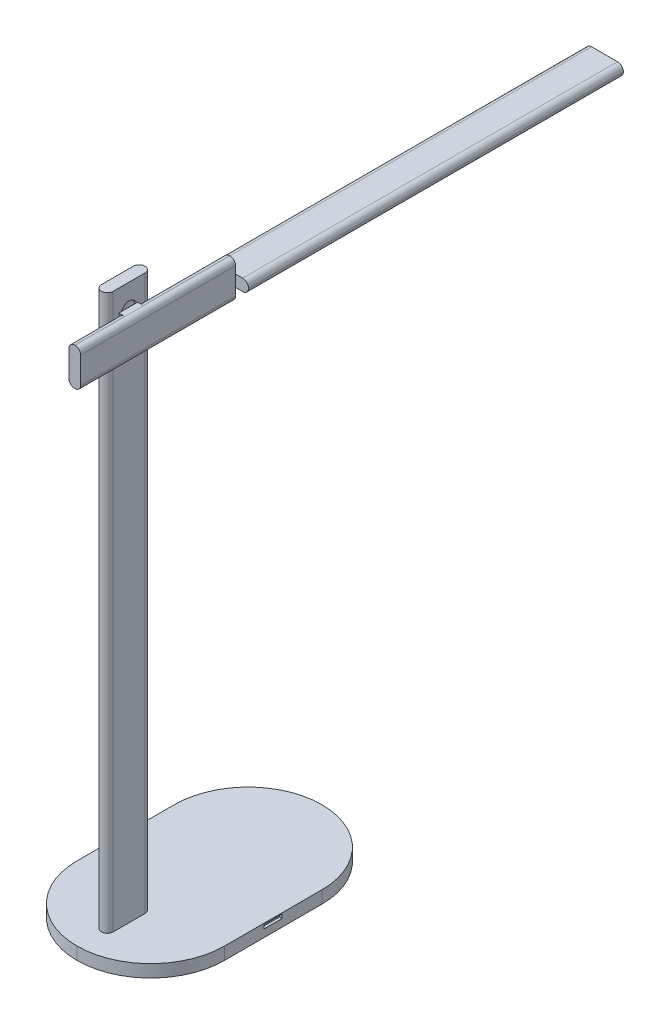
ISO-10303-21;
HEADER;
FILE_DESCRIPTION(('STEP AP214'),'2;1');
FILE_NAME('part.step','',(''),(''),'','','');
FILE_SCHEMA(('AUTOMOTIVE_DESIGN { 1 0 10303 214 1 1 1 1 }'));
ENDSEC;
DATA;
#1=APPLICATION_CONTEXT('core data for automotive mechanical design processes');
#2=APPLICATION_PROTOCOL_DEFINITION('international standard','automotive_design',2000,#1);
#3=PRODUCT_CONTEXT('',#1,'mechanical');
#4=PRODUCT('Part','Part','',(#3));
#5=PRODUCT_RELATED_PRODUCT_CATEGORY('part','',(#4));
#6=PRODUCT_DEFINITION_FORMATION('','',#4);
#7=PRODUCT_DEFINITION_CONTEXT('part definition',#1,'design');
#8=PRODUCT_DEFINITION('design','',#6,#7);
#9=PRODUCT_DEFINITION_SHAPE('','',#8);
#10=(LENGTH_UNIT() NAMED_UNIT(*) SI_UNIT(.MILLI.,.METRE.));
#11=(NAMED_UNIT(*) PLANE_ANGLE_UNIT() SI_UNIT($,.RADIAN.));
#12=(NAMED_UNIT(*) SI_UNIT($,.STERADIAN.) SOLID_ANGLE_UNIT());
#13=UNCERTAINTY_MEASURE_WITH_UNIT(LENGTH_MEASURE(1.E-05),#10,'distance_accuracy_value','');
#14=(GEOMETRIC_REPRESENTATION_CONTEXT(3) GLOBAL_UNCERTAINTY_ASSIGNED_CONTEXT((#13)) GLOBAL_UNIT_ASSIGNED_CONTEXT((#10,
#11,#12)) REPRESENTATION_CONTEXT('',''));
#15=CARTESIAN_POINT('',(0.,0.,0.));
#16=DIRECTION('',(0.,0.,1.));
#17=DIRECTION('',(1.,0.,0.));
#18=AXIS2_PLACEMENT_3D('',#15,#16,#17);
#19=CARTESIAN_POINT('',(4.67349772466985,454.,73.7138050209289));
#20=DIRECTION('',(-1.,0.,0.));
#21=DIRECTION('',(0.,0.,1.));
#22=AXIS2_PLACEMENT_3D('',#19,#20,#21);
#23=PLANE('',#22);
#24=DIRECTION('',(0.,0.,1.));
#25=VECTOR('',#24,1.);
#26=CARTESIAN_POINT('',(4.67349772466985,411.14864791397,-14.8985854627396));
#27=LINE('',#26,#25);
#28=CARTESIAN_POINT('',(4.67349772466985,411.14864791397,48.2219992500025));
#29=VERTEX_POINT('',#28);
#30=CARTESIAN_POINT('',(4.67349772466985,411.14864791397,54.1014145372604));
#31=VERTEX_POINT('',#30);
#32=EDGE_CURVE('E483',#29,#31,#27,.T.);
#33=ORIENTED_EDGE('',*,*,#32,.T.);
#34=DIRECTION('',(0.,1.,0.));
#35=VECTOR('',#34,1.);
#36=CARTESIAN_POINT('',(4.67349772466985,406.64864791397,54.1014145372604));
#37=LINE('',#36,#35);
#38=CARTESIAN_POINT('',(4.67349772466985,406.64864791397,54.1014145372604));
#39=VERTEX_POINT('',#38);
#40=EDGE_CURVE('E542',#39,#31,#37,.T.);
#41=ORIENTED_EDGE('',*,*,#40,.F.);
#42=DIRECTION('',(0.,0.,-1.));
#43=VECTOR('',#42,1.);
#44=CARTESIAN_POINT('',(4.67349772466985,406.64864791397,-14.8985854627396));
#45=LINE('',#44,#43);
#46=CARTESIAN_POINT('',(4.67349772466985,406.64864791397,55.0431185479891));
#47=VERTEX_POINT('',#46);
#48=EDGE_CURVE('E643',#47,#39,#45,.T.);
#49=ORIENTED_EDGE('',*,*,#48,.F.);
#50=CARTESIAN_POINT('',(4.67349772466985,408.468553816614,60.9679021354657));
#51=DIRECTION('',(1.,0.,0.));
#52=DIRECTION('',(0.,0.,-1.));
#53=AXIS2_PLACEMENT_3D('',#50,#51,#52);
#54=CIRCLE('',#53,6.19799306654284);
#55=CARTESIAN_POINT('',(4.67349772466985,406.64864791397,66.8926857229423));
#56=VERTEX_POINT('',#55);
#57=EDGE_CURVE('E671',#56,#47,#54,.T.);
#58=ORIENTED_EDGE('',*,*,#57,.F.);
#59=CARTESIAN_POINT('',(4.67349772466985,406.64864791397,69.1014145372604));
#60=VERTEX_POINT('',#59);
#61=EDGE_CURVE('E634',#60,#56,#45,.T.);
#62=ORIENTED_EDGE('',*,*,#61,.F.);
#63=DIRECTION('',(0.,-1.,0.));
#64=VECTOR('',#63,1.);
#65=CARTESIAN_POINT('',(4.67349772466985,436.64864791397,69.1014145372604));
#66=LINE('',#65,#64);
#67=CARTESIAN_POINT('',(4.67349772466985,411.14864791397,69.1014145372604));
#68=VERTEX_POINT('',#67);
#69=EDGE_CURVE('E560',#68,#60,#66,.T.);
#70=ORIENTED_EDGE('',*,*,#69,.F.);
#71=DIRECTION('',(0.,0.,1.));
#72=VECTOR('',#71,1.);
#73=CARTESIAN_POINT('',(4.67349772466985,411.14864791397,38.7393390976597));
#74=LINE('',#73,#72);
#75=CARTESIAN_POINT('',(4.67349772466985,411.14864791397,73.7138050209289));
#76=VERTEX_POINT('',#75);
#77=EDGE_CURVE('E520',#68,#76,#74,.T.);
#78=ORIENTED_EDGE('',*,*,#77,.T.);
#79=DIRECTION('',(0.,-1.,0.));
#80=VECTOR('',#79,1.);
#81=CARTESIAN_POINT('',(4.67349772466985,454.,73.7138050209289));
#82=LINE('',#81,#80);
#83=CARTESIAN_POINT('',(4.67349772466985,10.,73.7138050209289));
#84=VERTEX_POINT('',#83);
#85=EDGE_CURVE('E808',#76,#84,#82,.T.);
#86=ORIENTED_EDGE('',*,*,#85,.T.);
#87=DIRECTION('',(0.,0.,-1.));
#88=VECTOR('',#87,1.);
#89=CARTESIAN_POINT('',(4.67349772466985,10.,73.7138050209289));
#90=LINE('',#89,#88);
#91=CARTESIAN_POINT('',(4.67349772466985,10.,48.2219992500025));
#92=VERTEX_POINT('',#91);
#93=EDGE_CURVE('E787',#84,#92,#90,.T.);
#94=ORIENTED_EDGE('',*,*,#93,.T.);
#95=DIRECTION('',(0.,-1.,0.));
#96=VECTOR('',#95,1.);
#97=CARTESIAN_POINT('',(4.67349772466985,454.,48.2219992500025));
#98=LINE('',#97,#96);
#99=EDGE_CURVE('E65',#29,#92,#98,.T.);
#100=ORIENTED_EDGE('',*,*,#99,.F.);
#101=EDGE_LOOP('',(#33,#41,#49,#58,#62,#70,#78,#86,#94,#100));
#102=FACE_BOUND('',#101,.T.);
#103=ADVANCED_FACE('F41',(#102),#23,.F.);
#104=DIRECTION('',(0.,1.,0.));
#105=VECTOR('',#104,1.);
#106=CARTESIAN_POINT('',(4.67349772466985,411.14864791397,54.1014145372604));
#107=LINE('',#106,#105);
#108=CARTESIAN_POINT('',(4.67349772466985,415.450654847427,54.1014145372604));
#109=VERTEX_POINT('',#108);
#110=CARTESIAN_POINT('',(4.67349772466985,427.846640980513,54.1014145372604));
#111=VERTEX_POINT('',#110);
#112=EDGE_CURVE('E465',#109,#111,#107,.T.);
#113=ORIENTED_EDGE('',*,*,#112,.T.);
#114=DIRECTION('',(0.,0.,1.));
#115=VECTOR('',#114,1.);
#116=CARTESIAN_POINT('',(4.67349772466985,427.846640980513,47.7878080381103));
#117=LINE('',#116,#115);
#118=CARTESIAN_POINT('',(4.67349772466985,427.846640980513,54.7699090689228));
#119=VERTEX_POINT('',#118);
#120=EDGE_CURVE('E619',#111,#119,#117,.T.);
#121=ORIENTED_EDGE('',*,*,#120,.T.);
#122=DIRECTION('',(0.,1.,0.));
#123=VECTOR('',#122,1.);
#124=CARTESIAN_POINT('',(4.67349772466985,408.468553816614,54.7699090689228));
#125=LINE('',#124,#123);
#126=CARTESIAN_POINT('',(4.67349772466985,415.450654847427,54.7699090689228));
#127=VERTEX_POINT('',#126);
#128=EDGE_CURVE('E700',#127,#119,#125,.T.);
#129=ORIENTED_EDGE('',*,*,#128,.F.);
#130=DIRECTION('',(0.,0.,-1.));
#131=VECTOR('',#130,1.);
#132=CARTESIAN_POINT('',(4.67349772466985,415.450654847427,74.1479962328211));
#133=LINE('',#132,#131);
#134=EDGE_CURVE('E622',#127,#109,#133,.T.);
#135=ORIENTED_EDGE('',*,*,#134,.T.);
#136=EDGE_LOOP('',(#113,#121,#129,#135));
#137=FACE_BOUND('',#136,.T.);
#138=ADVANCED_FACE('F1148',(#137),#23,.F.);
#139=CARTESIAN_POINT('',(0.,0.,-14.8985854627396));
#140=DIRECTION('',(0.,0.,-1.));
#141=DIRECTION('',(-1.,0.,0.));
#142=AXIS2_PLACEMENT_3D('',#139,#140,#141);
#143=PLANE('',#142);
#144=DIRECTION('',(0.,1.,0.));
#145=VECTOR('',#144,1.);
#146=CARTESIAN_POINT('',(4.67349772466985,411.14864791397,-14.8985854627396));
#147=LINE('',#146,#145);
#148=CARTESIAN_POINT('',(4.67349772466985,416.97364791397,-14.8985854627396));
#149=VERTEX_POINT('',#148);
#150=CARTESIAN_POINT('',(4.67349772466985,426.32364791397,-14.8985854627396));
#151=VERTEX_POINT('',#150);
#152=EDGE_CURVE('E457',#149,#151,#147,.T.);
#153=ORIENTED_EDGE('',*,*,#152,.T.);
#154=DIRECTION('',(1.,0.,0.));
#155=VECTOR('',#154,1.);
#156=CARTESIAN_POINT('',(24.3484977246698,426.32364791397,-14.8985854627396));
#157=LINE('',#156,#155);
#158=CARTESIAN_POINT('',(-1.0015022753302,426.32364791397,-14.8985854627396));
#159=VERTEX_POINT('',#158);
#160=EDGE_CURVE('E601',#159,#151,#157,.T.);
#161=ORIENTED_EDGE('',*,*,#160,.F.);
#162=CARTESIAN_POINT('',(-1.0015022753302,421.67364791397,-14.8985854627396));
#163=DIRECTION('',(0.,0.,-1.));
#164=DIRECTION('',(-1.,0.,0.));
#165=AXIS2_PLACEMENT_3D('',#162,#163,#164);
#166=CIRCLE('',#165,4.65);
#167=CARTESIAN_POINT('',(-5.6515022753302,421.67364791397,-14.8985854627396));
#168=VERTEX_POINT('',#167);
#169=EDGE_CURVE('E912',#159,#168,#166,.F.);
#170=ORIENTED_EDGE('',*,*,#169,.T.);
#171=DIRECTION('',(0.,1.,0.));
#172=VECTOR('',#171,1.);
#173=CARTESIAN_POINT('',(-5.6515022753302,426.32364791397,-14.8985854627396));
#174=LINE('',#173,#172);
#175=CARTESIAN_POINT('',(-5.6515022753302,421.62364791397,-14.8985854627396));
#176=VERTEX_POINT('',#175);
#177=EDGE_CURVE('E575',#176,#168,#174,.T.);
#178=ORIENTED_EDGE('',*,*,#177,.F.);
#179=CARTESIAN_POINT('',(-1.0015022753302,421.62364791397,-14.8985854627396));
#180=DIRECTION('',(0.,0.,-1.));
#181=DIRECTION('',(-1.,0.,0.));
#182=AXIS2_PLACEMENT_3D('',#179,#180,#181);
#183=CIRCLE('',#182,4.65);
#184=CARTESIAN_POINT('',(-1.00150227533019,416.97364791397,-14.8985854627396));
#185=VERTEX_POINT('',#184);
#186=EDGE_CURVE('E915',#176,#185,#183,.F.);
#187=ORIENTED_EDGE('',*,*,#186,.T.);
#188=DIRECTION('',(-1.,0.,0.));
#189=VECTOR('',#188,1.);
#190=CARTESIAN_POINT('',(24.3484977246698,416.97364791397,-14.8985854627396));
#191=LINE('',#190,#189);
#192=EDGE_CURVE('E607',#149,#185,#191,.T.);
#193=ORIENTED_EDGE('',*,*,#192,.F.);
#194=EDGE_LOOP('',(#153,#161,#170,#178,#187,#193));
#195=FACE_BOUND('',#194,.T.);
#196=ADVANCED_FACE('F1084',(#195),#143,.F.);
#197=CARTESIAN_POINT('',(0.,0.,54.1014145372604));
#198=DIRECTION('',(0.,0.,-1.));
#199=DIRECTION('',(-1.,0.,0.));
#200=AXIS2_PLACEMENT_3D('',#197,#198,#199);
#201=PLANE('',#200);
#202=ORIENTED_EDGE('',*,*,#40,.T.);
#203=CARTESIAN_POINT('',(9.17349772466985,411.14864791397,54.1014145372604));
#204=DIRECTION('',(0.,0.,-1.));
#205=DIRECTION('',(-1.,0.,0.));
#206=AXIS2_PLACEMENT_3D('',#203,#204,#205);
#207=CIRCLE('',#206,4.5);
#208=CARTESIAN_POINT('',(9.17349772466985,406.64864791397,54.1014145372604));
#209=VERTEX_POINT('',#208);
#210=EDGE_CURVE('E440',#209,#31,#207,.T.);
#211=ORIENTED_EDGE('',*,*,#210,.F.);
#212=DIRECTION('',(-1.,0.,0.));
#213=VECTOR('',#212,1.);
#214=CARTESIAN_POINT('',(9.34849772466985,406.64864791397,54.1014145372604));
#215=LINE('',#214,#213);
#216=EDGE_CURVE('E538',#209,#39,#215,.T.);
#217=ORIENTED_EDGE('',*,*,#216,.T.);
#218=EDGE_LOOP('',(#202,#211,#217));
#219=FACE_BOUND('',#218,.T.);
#220=ADVANCED_FACE('F1110',(#219),#201,.T.);
#221=DIRECTION('',(1.,0.,0.));
#222=VECTOR('',#221,1.);
#223=CARTESIAN_POINT('',(4.67349772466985,436.64864791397,54.1014145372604));
#224=LINE('',#223,#222);
#225=CARTESIAN_POINT('',(4.67349772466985,436.64864791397,54.1014145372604));
#226=VERTEX_POINT('',#225);
#227=CARTESIAN_POINT('',(9.17349772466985,436.64864791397,54.1014145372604));
#228=VERTEX_POINT('',#227);
#229=EDGE_CURVE('E535',#226,#228,#224,.T.);
#230=ORIENTED_EDGE('',*,*,#229,.T.);
#231=CARTESIAN_POINT('',(9.17349772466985,432.14864791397,54.1014145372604));
#232=DIRECTION('',(0.,0.,-1.));
#233=DIRECTION('',(-1.,0.,0.));
#234=AXIS2_PLACEMENT_3D('',#231,#232,#233);
#235=CIRCLE('',#234,4.5);
#236=CARTESIAN_POINT('',(4.67349772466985,432.14864791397,54.1014145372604));
#237=VERTEX_POINT('',#236);
#238=EDGE_CURVE('E451',#237,#228,#235,.T.);
#239=ORIENTED_EDGE('',*,*,#238,.F.);
#240=EDGE_CURVE('E541',#237,#226,#37,.T.);
#241=ORIENTED_EDGE('',*,*,#240,.T.);
#242=EDGE_LOOP('',(#230,#239,#241));
#243=FACE_BOUND('',#242,.T.);
#244=ADVANCED_FACE('F1183',(#243),#201,.T.);
#245=DIRECTION('',(0.,1.,0.));
#246=VECTOR('',#245,1.);
#247=CARTESIAN_POINT('',(4.67349772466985,411.14864791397,69.1014145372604));
#248=LINE('',#247,#246);
#249=CARTESIAN_POINT('',(4.67349772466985,415.450654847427,69.1014145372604));
#250=VERTEX_POINT('',#249);
#251=CARTESIAN_POINT('',(4.67349772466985,427.846640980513,69.1014145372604));
#252=VERTEX_POINT('',#251);
#253=EDGE_CURVE('E496',#250,#252,#248,.T.);
#254=ORIENTED_EDGE('',*,*,#253,.F.);
#255=CARTESIAN_POINT('',(4.67349772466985,415.450654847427,67.1658952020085));
#256=VERTEX_POINT('',#255);
#257=EDGE_CURVE('E624',#250,#256,#133,.T.);
#258=ORIENTED_EDGE('',*,*,#257,.T.);
#259=DIRECTION('',(0.,-1.,0.));
#260=VECTOR('',#259,1.);
#261=CARTESIAN_POINT('',(4.67349772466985,408.468553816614,67.1658952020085));
#262=LINE('',#261,#260);
#263=CARTESIAN_POINT('',(4.67349772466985,427.846640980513,67.1658952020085));
#264=VERTEX_POINT('',#263);
#265=EDGE_CURVE('E705',#264,#256,#262,.T.);
#266=ORIENTED_EDGE('',*,*,#265,.F.);
#267=EDGE_CURVE('E618',#264,#252,#117,.T.);
#268=ORIENTED_EDGE('',*,*,#267,.T.);
#269=EDGE_LOOP('',(#254,#258,#266,#268));
#270=FACE_BOUND('',#269,.T.);
#271=ADVANCED_FACE('F1127',(#270),#23,.F.);
#272=CARTESIAN_POINT('',(0.,0.,69.1014145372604));
#273=DIRECTION('',(0.,0.,1.));
#274=DIRECTION('',(1.,0.,0.));
#275=AXIS2_PLACEMENT_3D('',#272,#273,#274);
#276=PLANE('',#275);
#277=CARTESIAN_POINT('',(9.17349772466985,411.14864791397,69.1014145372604));
#278=DIRECTION('',(0.,0.,1.));
#279=DIRECTION('',(1.,0.,0.));
#280=AXIS2_PLACEMENT_3D('',#277,#278,#279);
#281=CIRCLE('',#280,4.5);
#282=CARTESIAN_POINT('',(9.17349772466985,406.64864791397,69.1014145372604));
#283=VERTEX_POINT('',#282);
#284=EDGE_CURVE('E501',#283,#68,#281,.F.);
#285=ORIENTED_EDGE('',*,*,#284,.T.);
#286=ORIENTED_EDGE('',*,*,#69,.T.);
#287=DIRECTION('',(1.,0.,0.));
#288=VECTOR('',#287,1.);
#289=CARTESIAN_POINT('',(4.67349772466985,406.64864791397,69.1014145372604));
#290=LINE('',#289,#288);
#291=EDGE_CURVE('E565',#60,#283,#290,.T.);
#292=ORIENTED_EDGE('',*,*,#291,.T.);
#293=EDGE_LOOP('',(#285,#286,#292));
#294=FACE_BOUND('',#293,.T.);
#295=ADVANCED_FACE('F1182',(#294),#276,.T.);
#296=CARTESIAN_POINT('',(14.0234977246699,427.846640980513,47.7878080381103));
#297=DIRECTION('',(0.,-1.,0.));
#298=DIRECTION('',(0.,0.,-1.));
#299=AXIS2_PLACEMENT_3D('',#296,#297,#298);
#300=PLANE('',#299);
#301=ORIENTED_EDGE('',*,*,#120,.F.);
#302=DIRECTION('',(1.,0.,0.));
#303=VECTOR('',#302,1.);
#304=CARTESIAN_POINT('',(14.0234977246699,427.846640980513,54.1014145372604));
#305=LINE('',#304,#303);
#306=CARTESIAN_POINT('',(9.02349772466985,427.846640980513,54.1014145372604));
#307=VERTEX_POINT('',#306);
#308=EDGE_CURVE('E554',#111,#307,#305,.T.);
#309=ORIENTED_EDGE('',*,*,#308,.T.);
#310=DIRECTION('',(0.,0.,1.));
#311=VECTOR('',#310,1.);
#312=CARTESIAN_POINT('',(9.02349772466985,427.846640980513,47.7878080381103));
#313=LINE('',#312,#311);
#314=CARTESIAN_POINT('',(9.02349772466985,427.846640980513,69.1014145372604));
#315=VERTEX_POINT('',#314);
#316=EDGE_CURVE('E593',#307,#315,#313,.T.);
#317=ORIENTED_EDGE('',*,*,#316,.T.);
#318=DIRECTION('',(-1.,0.,0.));
#319=VECTOR('',#318,1.);
#320=CARTESIAN_POINT('',(14.0234977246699,427.846640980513,69.1014145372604));
#321=LINE('',#320,#319);
#322=EDGE_CURVE('E571',#315,#252,#321,.T.);
#323=ORIENTED_EDGE('',*,*,#322,.T.);
#324=ORIENTED_EDGE('',*,*,#267,.F.);
#325=EDGE_CURVE('E623',#119,#264,#117,.T.);
#326=ORIENTED_EDGE('',*,*,#325,.F.);
#327=EDGE_LOOP('',(#301,#309,#317,#323,#324,#326));
#328=FACE_BOUND('',#327,.T.);
#329=ADVANCED_FACE('F1150',(#328),#300,.T.);
#330=CARTESIAN_POINT('',(14.0234977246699,415.450654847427,74.1479962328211));
#331=DIRECTION('',(0.,1.,0.));
#332=DIRECTION('',(0.,0.,1.));
#333=AXIS2_PLACEMENT_3D('',#330,#331,#332);
#334=PLANE('',#333);
#335=DIRECTION('',(0.,0.,-1.));
#336=VECTOR('',#335,1.);
#337=CARTESIAN_POINT('',(9.02349772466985,415.450654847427,74.1479962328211));
#338=LINE('',#337,#336);
#339=CARTESIAN_POINT('',(9.02349772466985,415.450654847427,69.1014145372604));
#340=VERTEX_POINT('',#339);
#341=CARTESIAN_POINT('',(9.02349772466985,415.450654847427,54.1014145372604));
#342=VERTEX_POINT('',#341);
#343=EDGE_CURVE('E614',#340,#342,#338,.T.);
#344=ORIENTED_EDGE('',*,*,#343,.T.);
#345=DIRECTION('',(-1.,0.,0.));
#346=VECTOR('',#345,1.);
#347=CARTESIAN_POINT('',(14.0234977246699,415.450654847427,54.1014145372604));
#348=LINE('',#347,#346);
#349=EDGE_CURVE('E550',#342,#109,#348,.T.);
#350=ORIENTED_EDGE('',*,*,#349,.T.);
#351=ORIENTED_EDGE('',*,*,#134,.F.);
#352=EDGE_CURVE('E628',#256,#127,#133,.T.);
#353=ORIENTED_EDGE('',*,*,#352,.F.);
#354=ORIENTED_EDGE('',*,*,#257,.F.);
#355=DIRECTION('',(1.,0.,0.));
#356=VECTOR('',#355,1.);
#357=CARTESIAN_POINT('',(14.0234977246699,415.450654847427,69.1014145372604));
#358=LINE('',#357,#356);
#359=EDGE_CURVE('E568',#250,#340,#358,.T.);
#360=ORIENTED_EDGE('',*,*,#359,.T.);
#361=EDGE_LOOP('',(#344,#350,#351,#353,#354,#360));
#362=FACE_BOUND('',#361,.T.);
#363=ADVANCED_FACE('F1131',(#362),#334,.T.);
#364=CARTESIAN_POINT('',(9.02349772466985,421.64864791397,47.7878080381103));
#365=DIRECTION('',(1.,0.,0.));
#366=DIRECTION('',(0.,0.,-1.));
#367=AXIS2_PLACEMENT_3D('',#364,#365,#366);
#368=PLANE('',#367);
#369=DIRECTION('',(0.,1.,0.));
#370=VECTOR('',#369,1.);
#371=CARTESIAN_POINT('',(9.02349772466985,421.64864791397,54.1014145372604));
#372=LINE('',#371,#370);
#373=EDGE_CURVE('E546',#342,#307,#372,.T.);
#374=ORIENTED_EDGE('',*,*,#373,.F.);
#375=ORIENTED_EDGE('',*,*,#343,.F.);
#376=DIRECTION('',(0.,-1.,0.));
#377=VECTOR('',#376,1.);
#378=CARTESIAN_POINT('',(9.02349772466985,421.64864791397,69.1014145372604));
#379=LINE('',#378,#377);
#380=EDGE_CURVE('E11',#315,#340,#379,.T.);
#381=ORIENTED_EDGE('',*,*,#380,.F.);
#382=ORIENTED_EDGE('',*,*,#316,.F.);
#383=EDGE_LOOP('',(#374,#375,#381,#382));
#384=FACE_BOUND('',#383,.T.);
#385=ADVANCED_FACE('F1140',(#384),#368,.F.);
#386=CARTESIAN_POINT('',(14.0234977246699,436.64864791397,-14.8985854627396));
#387=DIRECTION('',(0.,0.,1.));
#388=DIRECTION('',(1.,0.,0.));
#389=AXIS2_PLACEMENT_3D('',#386,#387,#388);
#390=PLANE('',#389);
#391=DIRECTION('',(-1.,0.,0.));
#392=VECTOR('',#391,1.);
#393=CARTESIAN_POINT('',(14.0234977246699,406.64864791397,-14.8985854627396));
#394=LINE('',#393,#392);
#395=CARTESIAN_POINT('',(9.52349772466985,406.64864791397,-14.8985854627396));
#396=VERTEX_POINT('',#395);
#397=CARTESIAN_POINT('',(9.17349772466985,406.64864791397,-14.8985854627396));
#398=VERTEX_POINT('',#397);
#399=EDGE_CURVE('E650',#396,#398,#394,.T.);
#400=ORIENTED_EDGE('',*,*,#399,.T.);
#401=CARTESIAN_POINT('',(9.17349772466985,411.14864791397,-14.8985854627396));
#402=DIRECTION('',(0.,0.,-1.));
#403=DIRECTION('',(-1.,0.,0.));
#404=AXIS2_PLACEMENT_3D('',#401,#402,#403);
#405=CIRCLE('',#404,4.5);
#406=CARTESIAN_POINT('',(4.67349772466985,411.14864791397,-14.8985854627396));
#407=VERTEX_POINT('',#406);
#408=EDGE_CURVE('E446',#398,#407,#405,.T.);
#409=ORIENTED_EDGE('',*,*,#408,.T.);
#410=EDGE_CURVE('E452',#407,#149,#147,.T.);
#411=ORIENTED_EDGE('',*,*,#410,.T.);
#412=CARTESIAN_POINT('',(14.0234977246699,416.97364791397,-14.8985854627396));
#413=VERTEX_POINT('',#412);
#414=EDGE_CURVE('E611',#413,#149,#191,.T.);
#415=ORIENTED_EDGE('',*,*,#414,.F.);
#416=DIRECTION('',(0.,1.,0.));
#417=VECTOR('',#416,1.);
#418=CARTESIAN_POINT('',(14.0234977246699,436.64864791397,-14.8985854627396));
#419=LINE('',#418,#417);
#420=CARTESIAN_POINT('',(14.0234977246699,411.14864791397,-14.8985854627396));
#421=VERTEX_POINT('',#420);
#422=EDGE_CURVE('E635',#421,#413,#419,.T.);
#423=ORIENTED_EDGE('',*,*,#422,.F.);
#424=CARTESIAN_POINT('',(9.52349772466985,411.14864791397,-14.8985854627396));
#425=DIRECTION('',(0.,0.,1.));
#426=DIRECTION('',(1.,0.,0.));
#427=AXIS2_PLACEMENT_3D('',#424,#425,#426);
#428=CIRCLE('',#427,4.5);
#429=EDGE_CURVE('E934',#421,#396,#428,.F.);
#430=ORIENTED_EDGE('',*,*,#429,.T.);
#431=EDGE_LOOP('',(#400,#409,#411,#415,#423,#430));
#432=FACE_BOUND('',#431,.T.);
#433=ADVANCED_FACE('F1003',(#432),#390,.F.);
#434=CARTESIAN_POINT('',(14.0234977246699,426.32364791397,-14.8985854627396));
#435=VERTEX_POINT('',#434);
#436=EDGE_CURVE('E598',#151,#435,#157,.T.);
#437=ORIENTED_EDGE('',*,*,#436,.F.);
#438=CARTESIAN_POINT('',(4.67349772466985,432.14864791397,-14.8985854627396));
#439=VERTEX_POINT('',#438);
#440=EDGE_CURVE('E450',#151,#439,#147,.T.);
#441=ORIENTED_EDGE('',*,*,#440,.T.);
#442=CARTESIAN_POINT('',(9.17349772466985,432.14864791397,-14.8985854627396));
#443=DIRECTION('',(0.,0.,-1.));
#444=DIRECTION('',(-1.,0.,0.));
#445=AXIS2_PLACEMENT_3D('',#442,#443,#444);
#446=CIRCLE('',#445,4.5);
#447=CARTESIAN_POINT('',(9.17349772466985,436.64864791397,-14.8985854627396));
#448=VERTEX_POINT('',#447);
#449=EDGE_CURVE('E456',#439,#448,#446,.T.);
#450=ORIENTED_EDGE('',*,*,#449,.T.);
#451=DIRECTION('',(-1.,0.,0.));
#452=VECTOR('',#451,1.);
#453=CARTESIAN_POINT('',(14.0234977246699,436.64864791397,-14.8985854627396));
#454=LINE('',#453,#452);
#455=CARTESIAN_POINT('',(9.52349772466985,436.64864791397,-14.8985854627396));
#456=VERTEX_POINT('',#455);
#457=EDGE_CURVE('E638',#456,#448,#454,.T.);
#458=ORIENTED_EDGE('',*,*,#457,.F.);
#459=CARTESIAN_POINT('',(9.52349772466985,432.14864791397,-14.8985854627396));
#460=DIRECTION('',(0.,0.,1.));
#461=DIRECTION('',(1.,0.,0.));
#462=AXIS2_PLACEMENT_3D('',#459,#460,#461);
#463=CIRCLE('',#462,4.5);
#464=CARTESIAN_POINT('',(14.0234977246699,432.14864791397,-14.8985854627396));
#465=VERTEX_POINT('',#464);
#466=EDGE_CURVE('E50',#456,#465,#463,.F.);
#467=ORIENTED_EDGE('',*,*,#466,.T.);
#468=EDGE_CURVE('E633',#435,#465,#419,.T.);
#469=ORIENTED_EDGE('',*,*,#468,.F.);
#470=EDGE_LOOP('',(#437,#441,#450,#458,#467,#469));
#471=FACE_BOUND('',#470,.T.);
#472=ADVANCED_FACE('F954',(#471),#390,.F.);
#473=CARTESIAN_POINT('',(0.,10.,0.));
#474=DIRECTION('',(0.,-1.,0.));
#475=DIRECTION('',(0.,0.,-1.));
#476=AXIS2_PLACEMENT_3D('',#473,#474,#475);
#477=PLANE('',#476);
#478=CARTESIAN_POINT('',(0.,10.,-39.));
#479=DIRECTION('',(0.,-1.,0.));
#480=DIRECTION('',(0.,0.,-1.));
#481=AXIS2_PLACEMENT_3D('',#478,#479,#480);
#482=CIRCLE('',#481,59.);
#483=CARTESIAN_POINT('',(59.,10.,-39.));
#484=VERTEX_POINT('',#483);
#485=CARTESIAN_POINT('',(0.,10.,-98.));
#486=VERTEX_POINT('',#485);
#487=EDGE_CURVE('E862',#484,#486,#482,.F.);
#488=ORIENTED_EDGE('',*,*,#487,.T.);
#489=CARTESIAN_POINT('',(0.,10.,-39.));
#490=DIRECTION('',(0.,-1.,0.));
#491=DIRECTION('',(0.,0.,-1.));
#492=AXIS2_PLACEMENT_3D('',#489,#490,#491);
#493=CIRCLE('',#492,59.);
#494=CARTESIAN_POINT('',(-59.,10.,-39.));
#495=VERTEX_POINT('',#494);
#496=EDGE_CURVE('E865',#486,#495,#493,.F.);
#497=ORIENTED_EDGE('',*,*,#496,.T.);
#498=DIRECTION('',(0.,0.,1.));
#499=VECTOR('',#498,1.);
#500=CARTESIAN_POINT('',(-59.,10.,98.));
#501=LINE('',#500,#499);
#502=CARTESIAN_POINT('',(-59.,10.,39.));
#503=VERTEX_POINT('',#502);
#504=EDGE_CURVE('E818',#495,#503,#501,.T.);
#505=ORIENTED_EDGE('',*,*,#504,.T.);
#506=CARTESIAN_POINT('',(0.,10.,39.));
#507=DIRECTION('',(0.,-1.,0.));
#508=DIRECTION('',(0.,0.,-1.));
#509=AXIS2_PLACEMENT_3D('',#506,#507,#508);
#510=CIRCLE('',#509,59.);
#511=CARTESIAN_POINT('',(0.,10.,98.));
#512=VERTEX_POINT('',#511);
#513=EDGE_CURVE('E843',#503,#512,#510,.F.);
#514=ORIENTED_EDGE('',*,*,#513,.T.);
#515=CARTESIAN_POINT('',(0.,10.,39.));
#516=DIRECTION('',(0.,-1.,0.));
#517=DIRECTION('',(0.,0.,-1.));
#518=AXIS2_PLACEMENT_3D('',#515,#516,#517);
#519=CIRCLE('',#518,59.);
#520=CARTESIAN_POINT('',(59.,10.,39.));
#521=VERTEX_POINT('',#520);
#522=EDGE_CURVE('E840',#512,#521,#519,.F.);
#523=ORIENTED_EDGE('',*,*,#522,.T.);
#524=DIRECTION('',(0.,0.,-1.));
#525=VECTOR('',#524,1.);
#526=CARTESIAN_POINT('',(59.,10.,98.));
#527=LINE('',#526,#525);
#528=EDGE_CURVE('E814',#521,#484,#527,.T.);
#529=ORIENTED_EDGE('',*,*,#528,.T.);
#530=EDGE_LOOP('',(#488,#497,#505,#514,#523,#529));
#531=FACE_BOUND('',#530,.T.);
#532=CARTESIAN_POINT('',(0.,10.,73.7138050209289));
#533=DIRECTION('',(0.,1.,0.));
#534=DIRECTION('',(0.,0.,1.));
#535=AXIS2_PLACEMENT_3D('',#532,#533,#534);
#536=CIRCLE('',#535,4.67349772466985);
#537=CARTESIAN_POINT('',(-4.67349772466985,10.,73.7138050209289));
#538=VERTEX_POINT('',#537);
#539=EDGE_CURVE('E759',#538,#84,#536,.T.);
#540=ORIENTED_EDGE('',*,*,#539,.F.);
#541=DIRECTION('',(0.,0.,1.));
#542=VECTOR('',#541,1.);
#543=CARTESIAN_POINT('',(-4.67349772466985,10.,73.7138050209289));
#544=LINE('',#543,#542);
#545=CARTESIAN_POINT('',(-4.67349772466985,10.,48.2219992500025));
#546=VERTEX_POINT('',#545);
#547=EDGE_CURVE('E774',#546,#538,#544,.T.);
#548=ORIENTED_EDGE('',*,*,#547,.F.);
#549=CARTESIAN_POINT('',(0.,10.,48.2219992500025));
#550=DIRECTION('',(0.,1.,0.));
#551=DIRECTION('',(0.,0.,1.));
#552=AXIS2_PLACEMENT_3D('',#549,#550,#551);
#553=CIRCLE('',#552,4.67349772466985);
#554=EDGE_CURVE('E790',#92,#546,#553,.T.);
#555=ORIENTED_EDGE('',*,*,#554,.F.);
#556=ORIENTED_EDGE('',*,*,#93,.F.);
#557=EDGE_LOOP('',(#540,#548,#555,#556));
#558=FACE_BOUND('',#557,.T.);
#559=ADVANCED_FACE('F1432',(#531,#558),#477,.F.);
#560=CARTESIAN_POINT('',(59.,10.,98.));
#561=DIRECTION('',(-1.,0.,0.));
#562=DIRECTION('',(0.,0.,1.));
#563=AXIS2_PLACEMENT_3D('',#560,#561,#562);
#564=PLANE('',#563);
#565=DIRECTION('',(0.,0.,1.));
#566=VECTOR('',#565,1.);
#567=CARTESIAN_POINT('',(59.,9.15274328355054,7.15808394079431));
#568=LINE('',#567,#566);
#569=CARTESIAN_POINT('',(59.,9.15274328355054,-7.15808394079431));
#570=VERTEX_POINT('',#569);
#571=CARTESIAN_POINT('',(59.,9.15274328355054,7.15808394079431));
#572=VERTEX_POINT('',#571);
#573=EDGE_CURVE('E745',#570,#572,#568,.T.);
#574=ORIENTED_EDGE('',*,*,#573,.F.);
#575=DIRECTION('',(0.,1.,0.));
#576=VECTOR('',#575,1.);
#577=CARTESIAN_POINT('',(59.,6.05532832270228,-7.15808394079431));
#578=LINE('',#577,#576);
#579=CARTESIAN_POINT('',(59.,6.05532832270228,-7.15808394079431));
#580=VERTEX_POINT('',#579);
#581=EDGE_CURVE('E713',#580,#570,#578,.T.);
#582=ORIENTED_EDGE('',*,*,#581,.F.);
#583=DIRECTION('',(0.,0.,-1.));
#584=VECTOR('',#583,1.);
#585=CARTESIAN_POINT('',(59.,6.05532832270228,7.15808394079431));
#586=LINE('',#585,#584);
#587=CARTESIAN_POINT('',(59.,6.05532832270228,7.15808394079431));
#588=VERTEX_POINT('',#587);
#589=EDGE_CURVE('E730',#588,#580,#586,.T.);
#590=ORIENTED_EDGE('',*,*,#589,.F.);
#591=DIRECTION('',(0.,-1.,0.));
#592=VECTOR('',#591,1.);
#593=CARTESIAN_POINT('',(59.,6.05532832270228,7.15808394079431));
#594=LINE('',#593,#592);
#595=EDGE_CURVE('E749',#572,#588,#594,.T.);
#596=ORIENTED_EDGE('',*,*,#595,.F.);
#597=EDGE_LOOP('',(#574,#582,#590,#596));
#598=FACE_BOUND('',#597,.T.);
#599=DIRECTION('',(0.,0.,-1.));
#600=VECTOR('',#599,1.);
#601=CARTESIAN_POINT('',(59.,0.,98.));
#602=LINE('',#601,#600);
#603=CARTESIAN_POINT('',(59.,0.,39.));
#604=VERTEX_POINT('',#603);
#605=CARTESIAN_POINT('',(59.,0.,-39.));
#606=VERTEX_POINT('',#605);
#607=EDGE_CURVE('E823',#604,#606,#602,.T.);
#608=ORIENTED_EDGE('',*,*,#607,.T.);
#609=DIRECTION('',(0.,-1.,0.));
#610=VECTOR('',#609,1.);
#611=CARTESIAN_POINT('',(59.,10.,-39.));
#612=LINE('',#611,#610);
#613=EDGE_CURVE('E602',#606,#484,#612,.F.);
#614=ORIENTED_EDGE('',*,*,#613,.T.);
#615=ORIENTED_EDGE('',*,*,#528,.F.);
#616=DIRECTION('',(0.,-1.,0.));
#617=VECTOR('',#616,1.);
#618=CARTESIAN_POINT('',(59.,10.,39.));
#619=LINE('',#618,#617);
#620=EDGE_CURVE('E846',#521,#604,#619,.T.);
#621=ORIENTED_EDGE('',*,*,#620,.T.);
#622=EDGE_LOOP('',(#608,#614,#615,#621));
#623=FACE_BOUND('',#622,.T.);
#624=ADVANCED_FACE('F1503',(#598,#623),#564,.F.);
#625=CARTESIAN_POINT('',(-59.,10.,98.));
#626=DIRECTION('',(1.,0.,0.));
#627=DIRECTION('',(0.,0.,-1.));
#628=AXIS2_PLACEMENT_3D('',#625,#626,#627);
#629=PLANE('',#628);
#630=ORIENTED_EDGE('',*,*,#504,.F.);
#631=DIRECTION('',(0.,-1.,0.));
#632=VECTOR('',#631,1.);
#633=CARTESIAN_POINT('',(-59.,10.,-39.));
#634=LINE('',#633,#632);
#635=CARTESIAN_POINT('',(-59.,0.,-39.));
#636=VERTEX_POINT('',#635);
#637=EDGE_CURVE('E849',#495,#636,#634,.T.);
#638=ORIENTED_EDGE('',*,*,#637,.T.);
#639=DIRECTION('',(0.,0.,1.));
#640=VECTOR('',#639,1.);
#641=CARTESIAN_POINT('',(-59.,0.,98.));
#642=LINE('',#641,#640);
#643=CARTESIAN_POINT('',(-59.,0.,39.));
#644=VERTEX_POINT('',#643);
#645=EDGE_CURVE('E819',#636,#644,#642,.T.);
#646=ORIENTED_EDGE('',*,*,#645,.T.);
#647=DIRECTION('',(0.,-1.,0.));
#648=VECTOR('',#647,1.);
#649=CARTESIAN_POINT('',(-59.,10.,39.));
#650=LINE('',#649,#648);
#651=EDGE_CURVE('E836',#644,#503,#650,.F.);
#652=ORIENTED_EDGE('',*,*,#651,.T.);
#653=EDGE_LOOP('',(#630,#638,#646,#652));
#654=FACE_BOUND('',#653,.T.);
#655=ADVANCED_FACE('F1513',(#654),#629,.F.);
#656=CARTESIAN_POINT('',(0.,0.,0.));
#657=DIRECTION('',(0.,-1.,0.));
#658=DIRECTION('',(0.,0.,-1.));
#659=AXIS2_PLACEMENT_3D('',#656,#657,#658);
#660=PLANE('',#659);
#661=ORIENTED_EDGE('',*,*,#645,.F.);
#662=CARTESIAN_POINT('',(0.,0.,-39.));
#663=DIRECTION('',(0.,-1.,0.));
#664=DIRECTION('',(0.,0.,-1.));
#665=AXIS2_PLACEMENT_3D('',#662,#663,#664);
#666=CIRCLE('',#665,59.);
#667=CARTESIAN_POINT('',(0.,0.,-98.));
#668=VERTEX_POINT('',#667);
#669=EDGE_CURVE('E859',#636,#668,#666,.T.);
#670=ORIENTED_EDGE('',*,*,#669,.T.);
#671=CARTESIAN_POINT('',(0.,0.,-39.));
#672=DIRECTION('',(0.,-1.,0.));
#673=DIRECTION('',(0.,0.,-1.));
#674=AXIS2_PLACEMENT_3D('',#671,#672,#673);
#675=CIRCLE('',#674,59.);
#676=EDGE_CURVE('E856',#668,#606,#675,.T.);
#677=ORIENTED_EDGE('',*,*,#676,.T.);
#678=ORIENTED_EDGE('',*,*,#607,.F.);
#679=CARTESIAN_POINT('',(0.,0.,39.));
#680=DIRECTION('',(0.,-1.,0.));
#681=DIRECTION('',(0.,0.,-1.));
#682=AXIS2_PLACEMENT_3D('',#679,#680,#681);
#683=CIRCLE('',#682,59.);
#684=CARTESIAN_POINT('',(0.,0.,98.));
#685=VERTEX_POINT('',#684);
#686=EDGE_CURVE('E822',#604,#685,#683,.T.);
#687=ORIENTED_EDGE('',*,*,#686,.T.);
#688=CARTESIAN_POINT('',(0.,0.,39.));
#689=DIRECTION('',(0.,-1.,0.));
#690=DIRECTION('',(0.,0.,-1.));
#691=AXIS2_PLACEMENT_3D('',#688,#689,#690);
#692=CIRCLE('',#691,59.);
#693=EDGE_CURVE('E832',#685,#644,#692,.T.);
#694=ORIENTED_EDGE('',*,*,#693,.T.);
#695=EDGE_LOOP('',(#661,#670,#677,#678,#687,#694));
#696=FACE_BOUND('',#695,.T.);
#697=ADVANCED_FACE('F1523',(#696),#660,.T.);
#698=CARTESIAN_POINT('',(0.,10.,39.));
#699=DIRECTION('',(0.,-1.,0.));
#700=DIRECTION('',(0.,0.,-1.));
#701=AXIS2_PLACEMENT_3D('',#698,#699,#700);
#702=CYLINDRICAL_SURFACE('',#701,59.);
#703=ORIENTED_EDGE('',*,*,#620,.F.);
#704=ORIENTED_EDGE('',*,*,#522,.F.);
#705=DIRECTION('',(0.,-1.,0.));
#706=VECTOR('',#705,1.);
#707=CARTESIAN_POINT('',(0.,10.,98.));
#708=LINE('',#707,#706);
#709=EDGE_CURVE('E827',#685,#512,#708,.F.);
#710=ORIENTED_EDGE('',*,*,#709,.F.);
#711=ORIENTED_EDGE('',*,*,#686,.F.);
#712=EDGE_LOOP('',(#703,#704,#710,#711));
#713=FACE_BOUND('',#712,.T.);
#714=ADVANCED_FACE('F1532',(#713),#702,.T.);
#715=CARTESIAN_POINT('',(0.,10.,39.));
#716=DIRECTION('',(0.,-1.,0.));
#717=DIRECTION('',(0.,0.,-1.));
#718=AXIS2_PLACEMENT_3D('',#715,#716,#717);
#719=CYLINDRICAL_SURFACE('',#718,59.);
#720=ORIENTED_EDGE('',*,*,#513,.F.);
#721=ORIENTED_EDGE('',*,*,#651,.F.);
#722=ORIENTED_EDGE('',*,*,#693,.F.);
#723=ORIENTED_EDGE('',*,*,#709,.T.);
#724=EDGE_LOOP('',(#720,#721,#722,#723));
#725=FACE_BOUND('',#724,.T.);
#726=ADVANCED_FACE('F1541',(#725),#719,.T.);
#727=CARTESIAN_POINT('',(0.,10.,-39.));
#728=DIRECTION('',(0.,-1.,0.));
#729=DIRECTION('',(0.,0.,-1.));
#730=AXIS2_PLACEMENT_3D('',#727,#728,#729);
#731=CYLINDRICAL_SURFACE('',#730,59.);
#732=DIRECTION('',(0.,-1.,0.));
#733=VECTOR('',#732,1.);
#734=CARTESIAN_POINT('',(0.,10.,-98.));
#735=LINE('',#734,#733);
#736=EDGE_CURVE('E813',#486,#668,#735,.T.);
#737=ORIENTED_EDGE('',*,*,#736,.F.);
#738=ORIENTED_EDGE('',*,*,#487,.F.);
#739=ORIENTED_EDGE('',*,*,#613,.F.);
#740=ORIENTED_EDGE('',*,*,#676,.F.);
#741=EDGE_LOOP('',(#737,#738,#739,#740));
#742=FACE_BOUND('',#741,.T.);
#743=ADVANCED_FACE('F1548',(#742),#731,.T.);
#744=CARTESIAN_POINT('',(0.,10.,-39.));
#745=DIRECTION('',(0.,-1.,0.));
#746=DIRECTION('',(0.,0.,-1.));
#747=AXIS2_PLACEMENT_3D('',#744,#745,#746);
#748=CYLINDRICAL_SURFACE('',#747,59.);
#749=ORIENTED_EDGE('',*,*,#496,.F.);
#750=ORIENTED_EDGE('',*,*,#736,.T.);
#751=ORIENTED_EDGE('',*,*,#669,.F.);
#752=ORIENTED_EDGE('',*,*,#637,.F.);
#753=EDGE_LOOP('',(#749,#750,#751,#752));
#754=FACE_BOUND('',#753,.T.);
#755=ADVANCED_FACE('F1179',(#754),#748,.T.);
#756=CARTESIAN_POINT('',(0.,454.,73.7138050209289));
#757=DIRECTION('',(0.,-1.,0.));
#758=DIRECTION('',(0.,0.,-1.));
#759=AXIS2_PLACEMENT_3D('',#756,#757,#758);
#760=CYLINDRICAL_SURFACE('',#759,4.67349772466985);
#761=ORIENTED_EDGE('',*,*,#539,.T.);
#762=ORIENTED_EDGE('',*,*,#85,.F.);
#763=DIRECTION('',(0.,-1.,0.));
#764=VECTOR('',#763,1.);
#765=CARTESIAN_POINT('',(4.67349772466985,454.,73.7138050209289));
#766=LINE('',#765,#764);
#767=CARTESIAN_POINT('',(4.67349772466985,432.14864791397,73.7138050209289));
#768=VERTEX_POINT('',#767);
#769=EDGE_CURVE('E504',#768,#76,#766,.T.);
#770=ORIENTED_EDGE('',*,*,#769,.F.);
#771=CARTESIAN_POINT('',(4.67349772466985,454.,73.7138050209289));
#772=VERTEX_POINT('',#771);
#773=EDGE_CURVE('E809',#772,#768,#82,.T.);
#774=ORIENTED_EDGE('',*,*,#773,.F.);
#775=CARTESIAN_POINT('',(0.,454.,73.7138050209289));
#776=DIRECTION('',(0.,1.,0.));
#777=DIRECTION('',(0.,0.,1.));
#778=AXIS2_PLACEMENT_3D('',#775,#776,#777);
#779=CIRCLE('',#778,4.67349772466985);
#780=CARTESIAN_POINT('',(-4.67349772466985,454.,73.7138050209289));
#781=VERTEX_POINT('',#780);
#782=EDGE_CURVE('E769',#781,#772,#779,.T.);
#783=ORIENTED_EDGE('',*,*,#782,.F.);
#784=DIRECTION('',(0.,-1.,0.));
#785=VECTOR('',#784,1.);
#786=CARTESIAN_POINT('',(-4.67349772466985,454.,73.7138050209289));
#787=LINE('',#786,#785);
#788=EDGE_CURVE('E783',#781,#538,#787,.T.);
#789=ORIENTED_EDGE('',*,*,#788,.T.);
#790=EDGE_LOOP('',(#761,#762,#770,#774,#783,#789));
#791=FACE_BOUND('',#790,.T.);
#792=ADVANCED_FACE('F1172',(#791),#760,.T.);
#793=ORIENTED_EDGE('',*,*,#240,.F.);
#794=DIRECTION('',(0.,0.,1.));
#795=VECTOR('',#794,1.);
#796=CARTESIAN_POINT('',(4.67349772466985,432.14864791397,-14.8985854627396));
#797=LINE('',#796,#795);
#798=CARTESIAN_POINT('',(4.67349772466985,432.14864791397,48.2219992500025));
#799=VERTEX_POINT('',#798);
#800=EDGE_CURVE('E478',#799,#237,#797,.T.);
#801=ORIENTED_EDGE('',*,*,#800,.F.);
#802=CARTESIAN_POINT('',(4.67349772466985,454.,48.2219992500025));
#803=VERTEX_POINT('',#802);
#804=EDGE_CURVE('E804',#803,#799,#98,.T.);
#805=ORIENTED_EDGE('',*,*,#804,.F.);
#806=DIRECTION('',(0.,0.,-1.));
#807=VECTOR('',#806,1.);
#808=CARTESIAN_POINT('',(4.67349772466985,454.,73.7138050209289));
#809=LINE('',#808,#807);
#810=EDGE_CURVE('E773',#772,#803,#809,.T.);
#811=ORIENTED_EDGE('',*,*,#810,.F.);
#812=ORIENTED_EDGE('',*,*,#773,.T.);
#813=DIRECTION('',(0.,0.,1.));
#814=VECTOR('',#813,1.);
#815=CARTESIAN_POINT('',(4.67349772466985,432.14864791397,38.7393390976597));
#816=LINE('',#815,#814);
#817=CARTESIAN_POINT('',(4.67349772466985,432.14864791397,69.1014145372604));
#818=VERTEX_POINT('',#817);
#819=EDGE_CURVE('E524',#818,#768,#816,.T.);
#820=ORIENTED_EDGE('',*,*,#819,.F.);
#821=CARTESIAN_POINT('',(4.67349772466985,436.64864791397,69.1014145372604));
#822=VERTEX_POINT('',#821);
#823=EDGE_CURVE('E561',#822,#818,#66,.T.);
#824=ORIENTED_EDGE('',*,*,#823,.F.);
#825=DIRECTION('',(0.,0.,1.));
#826=VECTOR('',#825,1.);
#827=CARTESIAN_POINT('',(4.67349772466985,436.64864791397,-14.8985854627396));
#828=LINE('',#827,#826);
#829=CARTESIAN_POINT('',(4.67349772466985,436.64864791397,66.8926857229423));
#830=VERTEX_POINT('',#829);
#831=EDGE_CURVE('E627',#830,#822,#828,.T.);
#832=ORIENTED_EDGE('',*,*,#831,.F.);
#833=CARTESIAN_POINT('',(4.67349772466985,434.828742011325,60.9679021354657));
#834=DIRECTION('',(1.,0.,0.));
#835=DIRECTION('',(0.,0.,-1.));
#836=AXIS2_PLACEMENT_3D('',#833,#834,#835);
#837=CIRCLE('',#836,6.19799306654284);
#838=CARTESIAN_POINT('',(4.67349772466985,436.64864791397,55.043118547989));
#839=VERTEX_POINT('',#838);
#840=EDGE_CURVE('E699',#839,#830,#837,.T.);
#841=ORIENTED_EDGE('',*,*,#840,.F.);
#842=EDGE_CURVE('E640',#226,#839,#828,.T.);
#843=ORIENTED_EDGE('',*,*,#842,.F.);
#844=EDGE_LOOP('',(#793,#801,#805,#811,#812,#820,#824,#832,#841,#843));
#845=FACE_BOUND('',#844,.T.);
#846=ADVANCED_FACE('F1052',(#845),#23,.F.);
#847=CARTESIAN_POINT('',(0.,454.,48.2219992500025));
#848=DIRECTION('',(0.,-1.,0.));
#849=DIRECTION('',(0.,0.,-1.));
#850=AXIS2_PLACEMENT_3D('',#847,#848,#849);
#851=CYLINDRICAL_SURFACE('',#850,4.67349772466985);
#852=ORIENTED_EDGE('',*,*,#554,.T.);
#853=DIRECTION('',(0.,-1.,0.));
#854=VECTOR('',#853,1.);
#855=CARTESIAN_POINT('',(-4.67349772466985,454.,48.2219992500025));
#856=LINE('',#855,#854);
#857=CARTESIAN_POINT('',(-4.67349772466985,454.,48.2219992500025));
#858=VERTEX_POINT('',#857);
#859=EDGE_CURVE('E800',#858,#546,#856,.T.);
#860=ORIENTED_EDGE('',*,*,#859,.F.);
#861=CARTESIAN_POINT('',(0.,454.,48.2219992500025));
#862=DIRECTION('',(0.,1.,0.));
#863=DIRECTION('',(0.,0.,1.));
#864=AXIS2_PLACEMENT_3D('',#861,#862,#863);
#865=CIRCLE('',#864,4.67349772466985);
#866=EDGE_CURVE('E777',#803,#858,#865,.T.);
#867=ORIENTED_EDGE('',*,*,#866,.F.);
#868=ORIENTED_EDGE('',*,*,#804,.T.);
#869=DIRECTION('',(0.,-1.,0.));
#870=VECTOR('',#869,1.);
#871=CARTESIAN_POINT('',(4.67349772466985,454.,48.2219992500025));
#872=LINE('',#871,#870);
#873=EDGE_CURVE('E488',#799,#29,#872,.T.);
#874=ORIENTED_EDGE('',*,*,#873,.T.);
#875=ORIENTED_EDGE('',*,*,#99,.T.);
#876=EDGE_LOOP('',(#852,#860,#867,#868,#874,#875));
#877=FACE_BOUND('',#876,.T.);
#878=ADVANCED_FACE('F1171',(#877),#851,.T.);
#879=CARTESIAN_POINT('',(-4.67349772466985,454.,73.7138050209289));
#880=DIRECTION('',(1.,0.,0.));
#881=DIRECTION('',(0.,0.,-1.));
#882=AXIS2_PLACEMENT_3D('',#879,#880,#881);
#883=PLANE('',#882);
#884=ORIENTED_EDGE('',*,*,#547,.T.);
#885=ORIENTED_EDGE('',*,*,#788,.F.);
#886=DIRECTION('',(0.,0.,1.));
#887=VECTOR('',#886,1.);
#888=CARTESIAN_POINT('',(-4.67349772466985,454.,73.7138050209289));
#889=LINE('',#888,#887);
#890=EDGE_CURVE('E780',#858,#781,#889,.T.);
#891=ORIENTED_EDGE('',*,*,#890,.F.);
#892=ORIENTED_EDGE('',*,*,#859,.T.);
#893=EDGE_LOOP('',(#884,#885,#891,#892));
#894=FACE_BOUND('',#893,.T.);
#895=ADVANCED_FACE('F1177',(#894),#883,.F.);
#896=CARTESIAN_POINT('',(0.,454.,73.7138050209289));
#897=DIRECTION('',(0.,1.,0.));
#898=DIRECTION('',(0.,0.,1.));
#899=AXIS2_PLACEMENT_3D('',#896,#897,#898);
#900=PLANE('',#899);
#901=ORIENTED_EDGE('',*,*,#782,.T.);
#902=ORIENTED_EDGE('',*,*,#810,.T.);
#903=ORIENTED_EDGE('',*,*,#866,.T.);
#904=ORIENTED_EDGE('',*,*,#890,.T.);
#905=EDGE_LOOP('',(#901,#902,#903,#904));
#906=FACE_BOUND('',#905,.T.);
#907=ADVANCED_FACE('F1600',(#906),#900,.T.);
#908=CARTESIAN_POINT('',(57.,6.05532832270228,-7.15808394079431));
#909=DIRECTION('',(0.,0.,-1.));
#910=DIRECTION('',(-1.,0.,0.));
#911=AXIS2_PLACEMENT_3D('',#908,#909,#910);
#912=PLANE('',#911);
#913=ORIENTED_EDGE('',*,*,#581,.T.);
#914=DIRECTION('',(1.,0.,0.));
#915=VECTOR('',#914,1.);
#916=CARTESIAN_POINT('',(57.,9.15274328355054,-7.15808394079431));
#917=LINE('',#916,#915);
#918=CARTESIAN_POINT('',(57.,9.15274328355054,-7.15808394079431));
#919=VERTEX_POINT('',#918);
#920=EDGE_CURVE('E742',#919,#570,#917,.T.);
#921=ORIENTED_EDGE('',*,*,#920,.F.);
#922=DIRECTION('',(0.,1.,0.));
#923=VECTOR('',#922,1.);
#924=CARTESIAN_POINT('',(57.,6.05532832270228,-7.15808394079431));
#925=LINE('',#924,#923);
#926=CARTESIAN_POINT('',(57.,6.05532832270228,-7.15808394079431));
#927=VERTEX_POINT('',#926);
#928=EDGE_CURVE('E725',#927,#919,#925,.T.);
#929=ORIENTED_EDGE('',*,*,#928,.F.);
#930=DIRECTION('',(1.,0.,0.));
#931=VECTOR('',#930,1.);
#932=CARTESIAN_POINT('',(57.,6.05532832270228,-7.15808394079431));
#933=LINE('',#932,#931);
#934=EDGE_CURVE('E756',#927,#580,#933,.T.);
#935=ORIENTED_EDGE('',*,*,#934,.T.);
#936=EDGE_LOOP('',(#913,#921,#929,#935));
#937=FACE_BOUND('',#936,.T.);
#938=ADVANCED_FACE('F1606',(#937),#912,.F.);
#939=CARTESIAN_POINT('',(57.,6.05532832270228,7.15808394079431));
#940=DIRECTION('',(0.,-1.,0.));
#941=DIRECTION('',(0.,0.,-1.));
#942=AXIS2_PLACEMENT_3D('',#939,#940,#941);
#943=PLANE('',#942);
#944=ORIENTED_EDGE('',*,*,#589,.T.);
#945=ORIENTED_EDGE('',*,*,#934,.F.);
#946=DIRECTION('',(0.,0.,-1.));
#947=VECTOR('',#946,1.);
#948=CARTESIAN_POINT('',(57.,6.05532832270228,7.15808394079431));
#949=LINE('',#948,#947);
#950=CARTESIAN_POINT('',(57.,6.05532832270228,7.15808394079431));
#951=VERTEX_POINT('',#950);
#952=EDGE_CURVE('E738',#951,#927,#949,.T.);
#953=ORIENTED_EDGE('',*,*,#952,.F.);
#954=DIRECTION('',(1.,0.,0.));
#955=VECTOR('',#954,1.);
#956=CARTESIAN_POINT('',(57.,6.05532832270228,7.15808394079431));
#957=LINE('',#956,#955);
#958=EDGE_CURVE('E760',#951,#588,#957,.T.);
#959=ORIENTED_EDGE('',*,*,#958,.T.);
#960=EDGE_LOOP('',(#944,#945,#953,#959));
#961=FACE_BOUND('',#960,.T.);
#962=ADVANCED_FACE('F1613',(#961),#943,.F.);
#963=CARTESIAN_POINT('',(57.,6.05532832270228,7.15808394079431));
#964=DIRECTION('',(0.,0.,1.));
#965=DIRECTION('',(1.,0.,0.));
#966=AXIS2_PLACEMENT_3D('',#963,#964,#965);
#967=PLANE('',#966);
#968=ORIENTED_EDGE('',*,*,#595,.T.);
#969=ORIENTED_EDGE('',*,*,#958,.F.);
#970=DIRECTION('',(0.,-1.,0.));
#971=VECTOR('',#970,1.);
#972=CARTESIAN_POINT('',(57.,6.05532832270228,7.15808394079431));
#973=LINE('',#972,#971);
#974=CARTESIAN_POINT('',(57.,9.15274328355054,7.15808394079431));
#975=VERTEX_POINT('',#974);
#976=EDGE_CURVE('E734',#975,#951,#973,.T.);
#977=ORIENTED_EDGE('',*,*,#976,.F.);
#978=DIRECTION('',(1.,0.,0.));
#979=VECTOR('',#978,1.);
#980=CARTESIAN_POINT('',(57.,9.15274328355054,7.15808394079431));
#981=LINE('',#980,#979);
#982=EDGE_CURVE('E763',#975,#572,#981,.T.);
#983=ORIENTED_EDGE('',*,*,#982,.T.);
#984=EDGE_LOOP('',(#968,#969,#977,#983));
#985=FACE_BOUND('',#984,.T.);
#986=ADVANCED_FACE('F1621',(#985),#967,.F.);
#987=CARTESIAN_POINT('',(57.,9.15274328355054,7.15808394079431));
#988=DIRECTION('',(0.,1.,0.));
#989=DIRECTION('',(0.,0.,1.));
#990=AXIS2_PLACEMENT_3D('',#987,#988,#989);
#991=PLANE('',#990);
#992=ORIENTED_EDGE('',*,*,#573,.T.);
#993=ORIENTED_EDGE('',*,*,#982,.F.);
#994=DIRECTION('',(0.,0.,1.));
#995=VECTOR('',#994,1.);
#996=CARTESIAN_POINT('',(57.,9.15274328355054,7.15808394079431));
#997=LINE('',#996,#995);
#998=EDGE_CURVE('E729',#919,#975,#997,.T.);
#999=ORIENTED_EDGE('',*,*,#998,.F.);
#1000=ORIENTED_EDGE('',*,*,#920,.T.);
#1001=EDGE_LOOP('',(#992,#993,#999,#1000));
#1002=FACE_BOUND('',#1001,.T.);
#1003=ADVANCED_FACE('F1629',(#1002),#991,.F.);
#1004=CARTESIAN_POINT('',(57.,0.,0.));
#1005=DIRECTION('',(-1.,0.,0.));
#1006=DIRECTION('',(0.,0.,1.));
#1007=AXIS2_PLACEMENT_3D('',#1004,#1005,#1006);
#1008=PLANE('',#1007);
#1009=ORIENTED_EDGE('',*,*,#928,.T.);
#1010=ORIENTED_EDGE('',*,*,#998,.T.);
#1011=ORIENTED_EDGE('',*,*,#976,.T.);
#1012=ORIENTED_EDGE('',*,*,#952,.T.);
#1013=EDGE_LOOP('',(#1009,#1010,#1011,#1012));
#1014=FACE_BOUND('',#1013,.T.);
#1015=ADVANCED_FACE('F1637',(#1014),#1008,.F.);
#1016=CARTESIAN_POINT('',(2.67349772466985,408.468553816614,60.9679021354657));
#1017=DIRECTION('',(1.,0.,0.));
#1018=DIRECTION('',(0.,0.,-1.));
#1019=AXIS2_PLACEMENT_3D('',#1016,#1017,#1018);
#1020=CYLINDRICAL_SURFACE('',#1019,6.19799306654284);
#1021=CARTESIAN_POINT('',(4.67349772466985,408.468553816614,67.1658952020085));
#1022=VERTEX_POINT('',#1021);
#1023=EDGE_CURVE('E690',#1022,#56,#54,.T.);
#1024=ORIENTED_EDGE('',*,*,#1023,.T.);
#1025=ORIENTED_EDGE('',*,*,#57,.T.);
#1026=CARTESIAN_POINT('',(4.67349772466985,408.468553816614,60.9679021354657));
#1027=DIRECTION('',(-1.,0.,0.));
#1028=DIRECTION('',(0.,0.,1.));
#1029=AXIS2_PLACEMENT_3D('',#1026,#1027,#1028);
#1030=CIRCLE('',#1029,6.19799306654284);
#1031=CARTESIAN_POINT('',(4.67349772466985,408.468553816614,54.7699090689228));
#1032=VERTEX_POINT('',#1031);
#1033=EDGE_CURVE('E659',#47,#1032,#1030,.F.);
#1034=ORIENTED_EDGE('',*,*,#1033,.T.);
#1035=DIRECTION('',(1.,0.,0.));
#1036=VECTOR('',#1035,1.);
#1037=CARTESIAN_POINT('',(2.67349772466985,408.468553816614,54.7699090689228));
#1038=LINE('',#1037,#1036);
#1039=CARTESIAN_POINT('',(2.67349772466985,408.468553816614,54.7699090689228));
#1040=VERTEX_POINT('',#1039);
#1041=EDGE_CURVE('E689',#1040,#1032,#1038,.T.);
#1042=ORIENTED_EDGE('',*,*,#1041,.F.);
#1043=CARTESIAN_POINT('',(2.67349772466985,408.468553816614,60.9679021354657));
#1044=DIRECTION('',(1.,0.,0.));
#1045=DIRECTION('',(0.,0.,-1.));
#1046=AXIS2_PLACEMENT_3D('',#1043,#1044,#1045);
#1047=CIRCLE('',#1046,6.19799306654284);
#1048=CARTESIAN_POINT('',(2.67349772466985,408.468553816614,67.1658952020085));
#1049=VERTEX_POINT('',#1048);
#1050=EDGE_CURVE('E672',#1049,#1040,#1047,.T.);
#1051=ORIENTED_EDGE('',*,*,#1050,.F.);
#1052=DIRECTION('',(1.,0.,0.));
#1053=VECTOR('',#1052,1.);
#1054=CARTESIAN_POINT('',(2.67349772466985,408.468553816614,67.1658952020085));
#1055=LINE('',#1054,#1053);
#1056=EDGE_CURVE('E709',#1049,#1022,#1055,.T.);
#1057=ORIENTED_EDGE('',*,*,#1056,.T.);
#1058=EDGE_LOOP('',(#1024,#1025,#1034,#1042,#1051,#1057));
#1059=FACE_BOUND('',#1058,.T.);
#1060=ADVANCED_FACE('F1115',(#1059),#1020,.F.);
#1061=CARTESIAN_POINT('',(2.67349772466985,408.468553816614,67.1658952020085));
#1062=DIRECTION('',(0.,0.,1.));
#1063=DIRECTION('',(1.,0.,0.));
#1064=AXIS2_PLACEMENT_3D('',#1061,#1062,#1063);
#1065=PLANE('',#1064);
#1066=CARTESIAN_POINT('',(4.67349772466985,434.828742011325,67.1658952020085));
#1067=VERTEX_POINT('',#1066);
#1068=EDGE_CURVE('E677',#1067,#264,#262,.T.);
#1069=ORIENTED_EDGE('',*,*,#1068,.T.);
#1070=ORIENTED_EDGE('',*,*,#265,.T.);
#1071=DIRECTION('',(0.,-1.,0.));
#1072=VECTOR('',#1071,1.);
#1073=CARTESIAN_POINT('',(4.67349772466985,408.468553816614,67.1658952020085));
#1074=LINE('',#1073,#1072);
#1075=EDGE_CURVE('E664',#256,#1022,#1074,.T.);
#1076=ORIENTED_EDGE('',*,*,#1075,.T.);
#1077=ORIENTED_EDGE('',*,*,#1056,.F.);
#1078=DIRECTION('',(0.,-1.,0.));
#1079=VECTOR('',#1078,1.);
#1080=CARTESIAN_POINT('',(2.67349772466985,408.468553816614,67.1658952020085));
#1081=LINE('',#1080,#1079);
#1082=CARTESIAN_POINT('',(2.67349772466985,434.828742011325,67.1658952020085));
#1083=VERTEX_POINT('',#1082);
#1084=EDGE_CURVE('E685',#1083,#1049,#1081,.T.);
#1085=ORIENTED_EDGE('',*,*,#1084,.F.);
#1086=DIRECTION('',(1.,0.,0.));
#1087=VECTOR('',#1086,1.);
#1088=CARTESIAN_POINT('',(2.67349772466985,434.828742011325,67.1658952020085));
#1089=LINE('',#1088,#1087);
#1090=EDGE_CURVE('E714',#1083,#1067,#1089,.T.);
#1091=ORIENTED_EDGE('',*,*,#1090,.T.);
#1092=EDGE_LOOP('',(#1069,#1070,#1076,#1077,#1085,#1091));
#1093=FACE_BOUND('',#1092,.T.);
#1094=ADVANCED_FACE('F1123',(#1093),#1065,.F.);
#1095=CARTESIAN_POINT('',(2.67349772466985,434.828742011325,60.9679021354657));
#1096=DIRECTION('',(1.,0.,0.));
#1097=DIRECTION('',(0.,0.,-1.));
#1098=AXIS2_PLACEMENT_3D('',#1095,#1096,#1097);
#1099=CYLINDRICAL_SURFACE('',#1098,6.19799306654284);
#1100=CARTESIAN_POINT('',(4.67349772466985,434.828742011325,54.7699090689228));
#1101=VERTEX_POINT('',#1100);
#1102=EDGE_CURVE('E701',#1101,#839,#837,.T.);
#1103=ORIENTED_EDGE('',*,*,#1102,.T.);
#1104=ORIENTED_EDGE('',*,*,#840,.T.);
#1105=CARTESIAN_POINT('',(4.67349772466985,434.828742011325,60.9679021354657));
#1106=DIRECTION('',(-1.,0.,0.));
#1107=DIRECTION('',(0.,0.,1.));
#1108=AXIS2_PLACEMENT_3D('',#1105,#1106,#1107);
#1109=CIRCLE('',#1108,6.19799306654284);
#1110=EDGE_CURVE('E660',#830,#1067,#1109,.F.);
#1111=ORIENTED_EDGE('',*,*,#1110,.T.);
#1112=ORIENTED_EDGE('',*,*,#1090,.F.);
#1113=CARTESIAN_POINT('',(2.67349772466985,434.828742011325,60.9679021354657));
#1114=DIRECTION('',(1.,0.,0.));
#1115=DIRECTION('',(0.,0.,-1.));
#1116=AXIS2_PLACEMENT_3D('',#1113,#1114,#1115);
#1117=CIRCLE('',#1116,6.19799306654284);
#1118=CARTESIAN_POINT('',(2.67349772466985,434.828742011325,54.7699090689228));
#1119=VERTEX_POINT('',#1118);
#1120=EDGE_CURVE('E681',#1119,#1083,#1117,.T.);
#1121=ORIENTED_EDGE('',*,*,#1120,.F.);
#1122=DIRECTION('',(1.,0.,0.));
#1123=VECTOR('',#1122,1.);
#1124=CARTESIAN_POINT('',(2.67349772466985,434.828742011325,54.7699090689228));
#1125=LINE('',#1124,#1123);
#1126=EDGE_CURVE('E718',#1119,#1101,#1125,.T.);
#1127=ORIENTED_EDGE('',*,*,#1126,.T.);
#1128=EDGE_LOOP('',(#1103,#1104,#1111,#1112,#1121,#1127));
#1129=FACE_BOUND('',#1128,.T.);
#1130=ADVANCED_FACE('F1058',(#1129),#1099,.F.);
#1131=CARTESIAN_POINT('',(2.67349772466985,408.468553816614,54.7699090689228));
#1132=DIRECTION('',(0.,0.,-1.));
#1133=DIRECTION('',(-1.,0.,0.));
#1134=AXIS2_PLACEMENT_3D('',#1131,#1132,#1133);
#1135=PLANE('',#1134);
#1136=EDGE_CURVE('E695',#1032,#127,#125,.T.);
#1137=ORIENTED_EDGE('',*,*,#1136,.T.);
#1138=ORIENTED_EDGE('',*,*,#128,.T.);
#1139=EDGE_CURVE('E694',#119,#1101,#125,.T.);
#1140=ORIENTED_EDGE('',*,*,#1139,.T.);
#1141=ORIENTED_EDGE('',*,*,#1126,.F.);
#1142=DIRECTION('',(0.,1.,0.));
#1143=VECTOR('',#1142,1.);
#1144=CARTESIAN_POINT('',(2.67349772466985,408.468553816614,54.7699090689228));
#1145=LINE('',#1144,#1143);
#1146=EDGE_CURVE('E676',#1040,#1119,#1145,.T.);
#1147=ORIENTED_EDGE('',*,*,#1146,.F.);
#1148=ORIENTED_EDGE('',*,*,#1041,.T.);
#1149=EDGE_LOOP('',(#1137,#1138,#1140,#1141,#1147,#1148));
#1150=FACE_BOUND('',#1149,.T.);
#1151=ADVANCED_FACE('F1067',(#1150),#1135,.F.);
#1152=CARTESIAN_POINT('',(2.67349772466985,408.468553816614,60.9679021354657));
#1153=DIRECTION('',(1.,0.,0.));
#1154=DIRECTION('',(0.,0.,-1.));
#1155=AXIS2_PLACEMENT_3D('',#1152,#1153,#1154);
#1156=PLANE('',#1155);
#1157=ORIENTED_EDGE('',*,*,#1050,.T.);
#1158=ORIENTED_EDGE('',*,*,#1146,.T.);
#1159=ORIENTED_EDGE('',*,*,#1120,.T.);
#1160=ORIENTED_EDGE('',*,*,#1084,.T.);
#1161=EDGE_LOOP('',(#1157,#1158,#1159,#1160));
#1162=FACE_BOUND('',#1161,.T.);
#1163=ADVANCED_FACE('F1152',(#1162),#1156,.T.);
#1164=CARTESIAN_POINT('',(4.67349772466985,0.,0.));
#1165=DIRECTION('',(-1.,0.,0.));
#1166=DIRECTION('',(0.,0.,1.));
#1167=AXIS2_PLACEMENT_3D('',#1164,#1165,#1166);
#1168=PLANE('',#1167);
#1169=ORIENTED_EDGE('',*,*,#1023,.F.);
#1170=ORIENTED_EDGE('',*,*,#1075,.F.);
#1171=ORIENTED_EDGE('',*,*,#352,.T.);
#1172=ORIENTED_EDGE('',*,*,#1136,.F.);
#1173=ORIENTED_EDGE('',*,*,#1033,.F.);
#1174=EDGE_CURVE('E647',#56,#47,#45,.T.);
#1175=ORIENTED_EDGE('',*,*,#1174,.F.);
#1176=EDGE_LOOP('',(#1169,#1170,#1171,#1172,#1173,#1175));
#1177=FACE_BOUND('',#1176,.T.);
#1178=ADVANCED_FACE('F1120',(#1177),#1168,.T.);
#1179=ORIENTED_EDGE('',*,*,#1068,.F.);
#1180=ORIENTED_EDGE('',*,*,#1110,.F.);
#1181=EDGE_CURVE('E644',#839,#830,#828,.T.);
#1182=ORIENTED_EDGE('',*,*,#1181,.F.);
#1183=ORIENTED_EDGE('',*,*,#1102,.F.);
#1184=ORIENTED_EDGE('',*,*,#1139,.F.);
#1185=ORIENTED_EDGE('',*,*,#325,.T.);
#1186=EDGE_LOOP('',(#1179,#1180,#1182,#1183,#1184,#1185));
#1187=FACE_BOUND('',#1186,.T.);
#1188=ADVANCED_FACE('F1063',(#1187),#1168,.T.);
#1189=CARTESIAN_POINT('',(14.0234977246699,0.,0.));
#1190=DIRECTION('',(-1.,0.,0.));
#1191=DIRECTION('',(0.,0.,1.));
#1192=AXIS2_PLACEMENT_3D('',#1189,#1190,#1191);
#1193=PLANE('',#1192);
#1194=DIRECTION('',(0.,-1.,0.));
#1195=VECTOR('',#1194,1.);
#1196=CARTESIAN_POINT('',(14.0234977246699,406.64864791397,109.10141453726));
#1197=LINE('',#1196,#1195);
#1198=CARTESIAN_POINT('',(14.0234977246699,432.14864791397,109.10141453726));
#1199=VERTEX_POINT('',#1198);
#1200=CARTESIAN_POINT('',(14.0234977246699,411.14864791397,109.10141453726));
#1201=VERTEX_POINT('',#1200);
#1202=EDGE_CURVE('E629',#1199,#1201,#1197,.T.);
#1203=ORIENTED_EDGE('',*,*,#1202,.T.);
#1204=DIRECTION('',(0.,0.,-1.));
#1205=VECTOR('',#1204,1.);
#1206=CARTESIAN_POINT('',(14.0234977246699,411.14864791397,0.));
#1207=LINE('',#1206,#1205);
#1208=EDGE_CURVE('E930',#1201,#421,#1207,.T.);
#1209=ORIENTED_EDGE('',*,*,#1208,.T.);
#1210=ORIENTED_EDGE('',*,*,#422,.T.);
#1211=EDGE_CURVE('E639',#413,#435,#419,.T.);
#1212=ORIENTED_EDGE('',*,*,#1211,.T.);
#1213=ORIENTED_EDGE('',*,*,#468,.T.);
#1214=DIRECTION('',(0.,0.,1.));
#1215=VECTOR('',#1214,1.);
#1216=CARTESIAN_POINT('',(14.0234977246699,432.14864791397,0.));
#1217=LINE('',#1216,#1215);
#1218=EDGE_CURVE('E926',#465,#1199,#1217,.T.);
#1219=ORIENTED_EDGE('',*,*,#1218,.T.);
#1220=EDGE_LOOP('',(#1203,#1209,#1210,#1212,#1213,#1219));
#1221=FACE_BOUND('',#1220,.T.);
#1222=ADVANCED_FACE('F961',(#1221),#1193,.F.);
#1223=CARTESIAN_POINT('',(14.0234977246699,436.64864791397,-14.8985854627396));
#1224=DIRECTION('',(0.,-1.,0.));
#1225=DIRECTION('',(0.,0.,-1.));
#1226=AXIS2_PLACEMENT_3D('',#1223,#1224,#1225);
#1227=PLANE('',#1226);
#1228=ORIENTED_EDGE('',*,*,#457,.T.);
#1229=DIRECTION('',(0.,0.,1.));
#1230=VECTOR('',#1229,1.);
#1231=CARTESIAN_POINT('',(9.17349772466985,436.64864791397,-14.8985854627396));
#1232=LINE('',#1231,#1230);
#1233=EDGE_CURVE('E474',#448,#228,#1232,.T.);
#1234=ORIENTED_EDGE('',*,*,#1233,.T.);
#1235=ORIENTED_EDGE('',*,*,#229,.F.);
#1236=ORIENTED_EDGE('',*,*,#842,.T.);
#1237=ORIENTED_EDGE('',*,*,#1181,.T.);
#1238=ORIENTED_EDGE('',*,*,#831,.T.);
#1239=DIRECTION('',(-1.,0.,0.));
#1240=VECTOR('',#1239,1.);
#1241=CARTESIAN_POINT('',(9.34849772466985,436.64864791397,69.1014145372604));
#1242=LINE('',#1241,#1240);
#1243=CARTESIAN_POINT('',(9.17349772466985,436.64864791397,69.1014145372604));
#1244=VERTEX_POINT('',#1243);
#1245=EDGE_CURVE('E557',#1244,#822,#1242,.T.);
#1246=ORIENTED_EDGE('',*,*,#1245,.F.);
#1247=DIRECTION('',(0.,0.,1.));
#1248=VECTOR('',#1247,1.);
#1249=CARTESIAN_POINT('',(9.17349772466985,436.64864791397,38.7393390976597));
#1250=LINE('',#1249,#1248);
#1251=CARTESIAN_POINT('',(9.17349772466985,436.64864791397,109.10141453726));
#1252=VERTEX_POINT('',#1251);
#1253=EDGE_CURVE('E516',#1244,#1252,#1250,.T.);
#1254=ORIENTED_EDGE('',*,*,#1253,.T.);
#1255=DIRECTION('',(-1.,0.,0.));
#1256=VECTOR('',#1255,1.);
#1257=CARTESIAN_POINT('',(14.0234977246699,436.64864791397,109.10141453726));
#1258=LINE('',#1257,#1256);
#1259=CARTESIAN_POINT('',(9.52349772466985,436.64864791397,109.10141453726));
#1260=VERTEX_POINT('',#1259);
#1261=EDGE_CURVE('E656',#1260,#1252,#1258,.T.);
#1262=ORIENTED_EDGE('',*,*,#1261,.F.);
#1263=DIRECTION('',(0.,0.,1.));
#1264=VECTOR('',#1263,1.);
#1265=CARTESIAN_POINT('',(9.52349772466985,436.64864791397,-14.8985854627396));
#1266=LINE('',#1265,#1264);
#1267=EDGE_CURVE('E946',#1260,#456,#1266,.F.);
#1268=ORIENTED_EDGE('',*,*,#1267,.T.);
#1269=EDGE_LOOP('',(#1228,#1234,#1235,#1236,#1237,#1238,#1246,#1254,#1262,#1268));
#1270=FACE_BOUND('',#1269,.T.);
#1271=ADVANCED_FACE('F969',(#1270),#1227,.F.);
#1272=CARTESIAN_POINT('',(14.0234977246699,406.64864791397,109.10141453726));
#1273=DIRECTION('',(0.,0.,-1.));
#1274=DIRECTION('',(-1.,0.,0.));
#1275=AXIS2_PLACEMENT_3D('',#1272,#1273,#1274);
#1276=PLANE('',#1275);
#1277=ORIENTED_EDGE('',*,*,#1261,.T.);
#1278=CARTESIAN_POINT('',(9.17349772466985,432.14864791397,109.10141453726));
#1279=DIRECTION('',(0.,0.,1.));
#1280=DIRECTION('',(-1.,0.,0.));
#1281=AXIS2_PLACEMENT_3D('',#1278,#1279,#1280);
#1282=CIRCLE('',#1281,4.5);
#1283=CARTESIAN_POINT('',(4.67349772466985,432.14864791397,109.10141453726));
#1284=VERTEX_POINT('',#1283);
#1285=EDGE_CURVE('E491',#1252,#1284,#1282,.T.);
#1286=ORIENTED_EDGE('',*,*,#1285,.T.);
#1287=DIRECTION('',(0.,-1.,0.));
#1288=VECTOR('',#1287,1.);
#1289=CARTESIAN_POINT('',(4.67349772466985,411.14864791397,109.10141453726));
#1290=LINE('',#1289,#1288);
#1291=CARTESIAN_POINT('',(4.67349772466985,411.14864791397,109.10141453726));
#1292=VERTEX_POINT('',#1291);
#1293=EDGE_CURVE('E508',#1284,#1292,#1290,.T.);
#1294=ORIENTED_EDGE('',*,*,#1293,.T.);
#1295=CARTESIAN_POINT('',(9.17349772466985,411.14864791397,109.10141453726));
#1296=DIRECTION('',(0.,0.,1.));
#1297=DIRECTION('',(-1.,0.,0.));
#1298=AXIS2_PLACEMENT_3D('',#1295,#1296,#1297);
#1299=CIRCLE('',#1298,4.5);
#1300=CARTESIAN_POINT('',(9.17349772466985,406.64864791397,109.10141453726));
#1301=VERTEX_POINT('',#1300);
#1302=EDGE_CURVE('E512',#1292,#1301,#1299,.T.);
#1303=ORIENTED_EDGE('',*,*,#1302,.T.);
#1304=DIRECTION('',(-1.,0.,0.));
#1305=VECTOR('',#1304,1.);
#1306=CARTESIAN_POINT('',(14.0234977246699,406.64864791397,109.10141453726));
#1307=LINE('',#1306,#1305);
#1308=CARTESIAN_POINT('',(9.52349772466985,406.64864791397,109.10141453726));
#1309=VERTEX_POINT('',#1308);
#1310=EDGE_CURVE('E653',#1309,#1301,#1307,.T.);
#1311=ORIENTED_EDGE('',*,*,#1310,.F.);
#1312=CARTESIAN_POINT('',(9.52349772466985,411.14864791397,109.10141453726));
#1313=DIRECTION('',(0.,0.,-1.));
#1314=DIRECTION('',(-1.,0.,0.));
#1315=AXIS2_PLACEMENT_3D('',#1312,#1313,#1314);
#1316=CIRCLE('',#1315,4.5);
#1317=EDGE_CURVE('E943',#1309,#1201,#1316,.F.);
#1318=ORIENTED_EDGE('',*,*,#1317,.T.);
#1319=ORIENTED_EDGE('',*,*,#1202,.F.);
#1320=CARTESIAN_POINT('',(9.52349772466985,432.14864791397,109.10141453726));
#1321=DIRECTION('',(0.,0.,-1.));
#1322=DIRECTION('',(-1.,0.,0.));
#1323=AXIS2_PLACEMENT_3D('',#1320,#1321,#1322);
#1324=CIRCLE('',#1323,4.5);
#1325=EDGE_CURVE('E940',#1199,#1260,#1324,.F.);
#1326=ORIENTED_EDGE('',*,*,#1325,.T.);
#1327=EDGE_LOOP('',(#1277,#1286,#1294,#1303,#1311,#1318,#1319,#1326));
#1328=FACE_BOUND('',#1327,.T.);
#1329=ADVANCED_FACE('F967',(#1328),#1276,.F.);
#1330=CARTESIAN_POINT('',(14.0234977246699,406.64864791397,-14.8985854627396));
#1331=DIRECTION('',(0.,1.,0.));
#1332=DIRECTION('',(0.,0.,1.));
#1333=AXIS2_PLACEMENT_3D('',#1330,#1331,#1332);
#1334=PLANE('',#1333);
#1335=DIRECTION('',(0.,0.,1.));
#1336=VECTOR('',#1335,1.);
#1337=CARTESIAN_POINT('',(9.17349772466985,406.64864791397,-14.8985854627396));
#1338=LINE('',#1337,#1336);
#1339=EDGE_CURVE('E461',#398,#209,#1338,.T.);
#1340=ORIENTED_EDGE('',*,*,#1339,.F.);
#1341=ORIENTED_EDGE('',*,*,#399,.F.);
#1342=DIRECTION('',(0.,0.,-1.));
#1343=VECTOR('',#1342,1.);
#1344=CARTESIAN_POINT('',(9.52349772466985,406.64864791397,-14.8985854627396));
#1345=LINE('',#1344,#1343);
#1346=EDGE_CURVE('E937',#396,#1309,#1345,.F.);
#1347=ORIENTED_EDGE('',*,*,#1346,.T.);
#1348=ORIENTED_EDGE('',*,*,#1310,.T.);
#1349=DIRECTION('',(0.,0.,1.));
#1350=VECTOR('',#1349,1.);
#1351=CARTESIAN_POINT('',(9.17349772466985,406.64864791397,38.7393390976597));
#1352=LINE('',#1351,#1350);
#1353=EDGE_CURVE('E497',#283,#1301,#1352,.T.);
#1354=ORIENTED_EDGE('',*,*,#1353,.F.);
#1355=ORIENTED_EDGE('',*,*,#291,.F.);
#1356=ORIENTED_EDGE('',*,*,#61,.T.);
#1357=ORIENTED_EDGE('',*,*,#1174,.T.);
#1358=ORIENTED_EDGE('',*,*,#48,.T.);
#1359=ORIENTED_EDGE('',*,*,#216,.F.);
#1360=EDGE_LOOP('',(#1340,#1341,#1347,#1348,#1354,#1355,#1356,#1357,#1358,#1359));
#1361=FACE_BOUND('',#1360,.T.);
#1362=ADVANCED_FACE('F992',(#1361),#1334,.F.);
#1363=CARTESIAN_POINT('',(-5.6515022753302,426.32364791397,-314.89858546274));
#1364=DIRECTION('',(1.,0.,0.));
#1365=DIRECTION('',(0.,1.,0.));
#1366=AXIS2_PLACEMENT_3D('',#1363,#1364,#1365);
#1367=PLANE('',#1366);
#1368=DIRECTION('',(0.,1.,0.));
#1369=VECTOR('',#1368,1.);
#1370=CARTESIAN_POINT('',(-5.6515022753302,426.32364791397,-314.89858546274));
#1371=LINE('',#1370,#1369);
#1372=CARTESIAN_POINT('',(-5.6515022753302,421.62364791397,-314.89858546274));
#1373=VERTEX_POINT('',#1372);
#1374=CARTESIAN_POINT('',(-5.6515022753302,421.67364791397,-314.89858546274));
#1375=VERTEX_POINT('',#1374);
#1376=EDGE_CURVE('E576',#1373,#1375,#1371,.T.);
#1377=ORIENTED_EDGE('',*,*,#1376,.F.);
#1378=DIRECTION('',(0.,0.,1.));
#1379=VECTOR('',#1378,1.);
#1380=CARTESIAN_POINT('',(-5.6515022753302,421.62364791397,-314.89858546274));
#1381=LINE('',#1380,#1379);
#1382=EDGE_CURVE('E908',#1373,#176,#1381,.T.);
#1383=ORIENTED_EDGE('',*,*,#1382,.T.);
#1384=ORIENTED_EDGE('',*,*,#177,.T.);
#1385=DIRECTION('',(0.,0.,1.));
#1386=VECTOR('',#1385,1.);
#1387=CARTESIAN_POINT('',(-5.6515022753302,421.67364791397,-314.89858546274));
#1388=LINE('',#1387,#1386);
#1389=EDGE_CURVE('E905',#168,#1375,#1388,.F.);
#1390=ORIENTED_EDGE('',*,*,#1389,.T.);
#1391=EDGE_LOOP('',(#1377,#1383,#1384,#1390));
#1392=FACE_BOUND('',#1391,.T.);
#1393=ADVANCED_FACE('F1092',(#1392),#1367,.F.);
#1394=CARTESIAN_POINT('',(24.3484977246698,426.32364791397,-314.89858546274));
#1395=DIRECTION('',(0.,-1.,0.));
#1396=DIRECTION('',(0.,0.,-1.));
#1397=AXIS2_PLACEMENT_3D('',#1394,#1395,#1396);
#1398=PLANE('',#1397);
#1399=DIRECTION('',(1.,0.,0.));
#1400=VECTOR('',#1399,1.);
#1401=CARTESIAN_POINT('',(24.3484977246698,426.32364791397,-314.89858546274));
#1402=LINE('',#1401,#1400);
#1403=CARTESIAN_POINT('',(-1.0015022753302,426.32364791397,-314.89858546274));
#1404=VERTEX_POINT('',#1403);
#1405=CARTESIAN_POINT('',(19.6984977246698,426.32364791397,-314.89858546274));
#1406=VERTEX_POINT('',#1405);
#1407=EDGE_CURVE('E580',#1404,#1406,#1402,.T.);
#1408=ORIENTED_EDGE('',*,*,#1407,.F.);
#1409=DIRECTION('',(0.,0.,1.));
#1410=VECTOR('',#1409,1.);
#1411=CARTESIAN_POINT('',(-1.0015022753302,426.32364791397,-314.89858546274));
#1412=LINE('',#1411,#1410);
#1413=EDGE_CURVE('E922',#1404,#159,#1412,.T.);
#1414=ORIENTED_EDGE('',*,*,#1413,.T.);
#1415=ORIENTED_EDGE('',*,*,#160,.T.);
#1416=ORIENTED_EDGE('',*,*,#436,.T.);
#1417=CARTESIAN_POINT('',(19.6984977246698,426.32364791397,-14.8985854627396));
#1418=VERTEX_POINT('',#1417);
#1419=EDGE_CURVE('E597',#435,#1418,#157,.T.);
#1420=ORIENTED_EDGE('',*,*,#1419,.T.);
#1421=DIRECTION('',(0.,0.,1.));
#1422=VECTOR('',#1421,1.);
#1423=CARTESIAN_POINT('',(19.6984977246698,426.32364791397,-314.89858546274));
#1424=LINE('',#1423,#1422);
#1425=EDGE_CURVE('E919',#1418,#1406,#1424,.F.);
#1426=ORIENTED_EDGE('',*,*,#1425,.T.);
#1427=EDGE_LOOP('',(#1408,#1414,#1415,#1416,#1420,#1426));
#1428=FACE_BOUND('',#1427,.T.);
#1429=ADVANCED_FACE('F1080',(#1428),#1398,.F.);
#1430=CARTESIAN_POINT('',(24.3484977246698,426.32364791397,-314.89858546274));
#1431=DIRECTION('',(-1.,0.,0.));
#1432=DIRECTION('',(0.,0.,1.));
#1433=AXIS2_PLACEMENT_3D('',#1430,#1431,#1432);
#1434=PLANE('',#1433);
#1435=DIRECTION('',(0.,-1.,0.));
#1436=VECTOR('',#1435,1.);
#1437=CARTESIAN_POINT('',(24.3484977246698,426.32364791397,-14.8985854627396));
#1438=LINE('',#1437,#1436);
#1439=CARTESIAN_POINT('',(24.3484977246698,421.67364791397,-14.8985854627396));
#1440=VERTEX_POINT('',#1439);
#1441=CARTESIAN_POINT('',(24.3484977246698,421.62364791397,-14.8985854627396));
#1442=VERTEX_POINT('',#1441);
#1443=EDGE_CURVE('E603',#1440,#1442,#1438,.T.);
#1444=ORIENTED_EDGE('',*,*,#1443,.T.);
#1445=DIRECTION('',(0.,0.,1.));
#1446=VECTOR('',#1445,1.);
#1447=CARTESIAN_POINT('',(24.3484977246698,421.62364791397,-314.89858546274));
#1448=LINE('',#1447,#1446);
#1449=CARTESIAN_POINT('',(24.3484977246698,421.62364791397,-314.89858546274));
#1450=VERTEX_POINT('',#1449);
#1451=EDGE_CURVE('E890',#1442,#1450,#1448,.F.);
#1452=ORIENTED_EDGE('',*,*,#1451,.T.);
#1453=DIRECTION('',(0.,-1.,0.));
#1454=VECTOR('',#1453,1.);
#1455=CARTESIAN_POINT('',(24.3484977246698,426.32364791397,-314.89858546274));
#1456=LINE('',#1455,#1454);
#1457=CARTESIAN_POINT('',(24.3484977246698,421.67364791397,-314.89858546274));
#1458=VERTEX_POINT('',#1457);
#1459=EDGE_CURVE('E585',#1458,#1450,#1456,.T.);
#1460=ORIENTED_EDGE('',*,*,#1459,.F.);
#1461=DIRECTION('',(0.,0.,1.));
#1462=VECTOR('',#1461,1.);
#1463=CARTESIAN_POINT('',(24.3484977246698,421.67364791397,-314.89858546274));
#1464=LINE('',#1463,#1462);
#1465=EDGE_CURVE('E886',#1458,#1440,#1464,.T.);
#1466=ORIENTED_EDGE('',*,*,#1465,.T.);
#1467=EDGE_LOOP('',(#1444,#1452,#1460,#1466));
#1468=FACE_BOUND('',#1467,.T.);
#1469=ADVANCED_FACE('F1208',(#1468),#1434,.F.);
#1470=CARTESIAN_POINT('',(24.3484977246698,416.97364791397,-314.89858546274));
#1471=DIRECTION('',(0.,1.,0.));
#1472=DIRECTION('',(0.,0.,1.));
#1473=AXIS2_PLACEMENT_3D('',#1470,#1471,#1472);
#1474=PLANE('',#1473);
#1475=DIRECTION('',(1.,0.,0.));
#1476=VECTOR('',#1475,1.);
#1477=CARTESIAN_POINT('',(18.6969954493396,416.97364791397,-313.653720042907));
#1478=LINE('',#1477,#1476);
#1479=CARTESIAN_POINT('',(0.,416.97364791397,-313.653720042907));
#1480=VERTEX_POINT('',#1479);
#1481=CARTESIAN_POINT('',(18.6969954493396,416.97364791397,-313.653720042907));
#1482=VERTEX_POINT('',#1481);
#1483=EDGE_CURVE('E431',#1480,#1482,#1478,.T.);
#1484=ORIENTED_EDGE('',*,*,#1483,.F.);
#1485=DIRECTION('',(0.,0.,-1.));
#1486=VECTOR('',#1485,1.);
#1487=CARTESIAN_POINT('',(0.,416.97364791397,-16.1434508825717));
#1488=LINE('',#1487,#1486);
#1489=CARTESIAN_POINT('',(0.,416.97364791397,-16.1434508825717));
#1490=VERTEX_POINT('',#1489);
#1491=EDGE_CURVE('E57',#1490,#1480,#1488,.T.);
#1492=ORIENTED_EDGE('',*,*,#1491,.F.);
#1493=DIRECTION('',(-1.,0.,0.));
#1494=VECTOR('',#1493,1.);
#1495=CARTESIAN_POINT('',(18.6969954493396,416.97364791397,-16.1434508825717));
#1496=LINE('',#1495,#1494);
#1497=CARTESIAN_POINT('',(18.6969954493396,416.97364791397,-16.1434508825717));
#1498=VERTEX_POINT('',#1497);
#1499=EDGE_CURVE('E418',#1498,#1490,#1496,.T.);
#1500=ORIENTED_EDGE('',*,*,#1499,.F.);
#1501=DIRECTION('',(0.,0.,1.));
#1502=VECTOR('',#1501,1.);
#1503=CARTESIAN_POINT('',(18.6969954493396,416.97364791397,-16.1434508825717));
#1504=LINE('',#1503,#1502);
#1505=EDGE_CURVE('E422',#1482,#1498,#1504,.T.);
#1506=ORIENTED_EDGE('',*,*,#1505,.F.);
#1507=EDGE_LOOP('',(#1484,#1492,#1500,#1506));
#1508=FACE_BOUND('',#1507,.T.);
#1509=DIRECTION('',(-1.,0.,0.));
#1510=VECTOR('',#1509,1.);
#1511=CARTESIAN_POINT('',(24.3484977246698,416.97364791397,-314.89858546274));
#1512=LINE('',#1511,#1510);
#1513=CARTESIAN_POINT('',(19.6984977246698,416.97364791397,-314.89858546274));
#1514=VERTEX_POINT('',#1513);
#1515=CARTESIAN_POINT('',(-1.00150227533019,416.97364791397,-314.89858546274));
#1516=VERTEX_POINT('',#1515);
#1517=EDGE_CURVE('E589',#1514,#1516,#1512,.T.);
#1518=ORIENTED_EDGE('',*,*,#1517,.F.);
#1519=DIRECTION('',(0.,0.,1.));
#1520=VECTOR('',#1519,1.);
#1521=CARTESIAN_POINT('',(19.6984977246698,416.97364791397,-314.89858546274));
#1522=LINE('',#1521,#1520);
#1523=CARTESIAN_POINT('',(19.6984977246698,416.97364791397,-14.8985854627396));
#1524=VERTEX_POINT('',#1523);
#1525=EDGE_CURVE('E876',#1514,#1524,#1522,.T.);
#1526=ORIENTED_EDGE('',*,*,#1525,.T.);
#1527=EDGE_CURVE('E581',#1524,#413,#191,.T.);
#1528=ORIENTED_EDGE('',*,*,#1527,.T.);
#1529=ORIENTED_EDGE('',*,*,#414,.T.);
#1530=ORIENTED_EDGE('',*,*,#192,.T.);
#1531=DIRECTION('',(0.,0.,1.));
#1532=VECTOR('',#1531,1.);
#1533=CARTESIAN_POINT('',(-1.0015022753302,416.97364791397,-314.89858546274));
#1534=LINE('',#1533,#1532);
#1535=EDGE_CURVE('E873',#185,#1516,#1534,.F.);
#1536=ORIENTED_EDGE('',*,*,#1535,.T.);
#1537=EDGE_LOOP('',(#1518,#1526,#1528,#1529,#1530,#1536));
#1538=FACE_BOUND('',#1537,.T.);
#1539=ADVANCED_FACE('F1202',(#1508,#1538),#1474,.F.);
#1540=CARTESIAN_POINT('',(0.,0.,-314.89858546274));
#1541=DIRECTION('',(0.,0.,-1.));
#1542=DIRECTION('',(-1.,0.,0.));
#1543=AXIS2_PLACEMENT_3D('',#1540,#1541,#1542);
#1544=PLANE('',#1543);
#1545=ORIENTED_EDGE('',*,*,#1459,.T.);
#1546=CARTESIAN_POINT('',(19.6984977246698,421.62364791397,-314.89858546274));
#1547=DIRECTION('',(0.,0.,-1.));
#1548=DIRECTION('',(-1.,0.,0.));
#1549=AXIS2_PLACEMENT_3D('',#1546,#1547,#1548);
#1550=CIRCLE('',#1549,4.65);
#1551=EDGE_CURVE('E902',#1450,#1514,#1550,.T.);
#1552=ORIENTED_EDGE('',*,*,#1551,.T.);
#1553=ORIENTED_EDGE('',*,*,#1517,.T.);
#1554=CARTESIAN_POINT('',(-1.0015022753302,421.62364791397,-314.89858546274));
#1555=DIRECTION('',(0.,0.,-1.));
#1556=DIRECTION('',(-1.,0.,0.));
#1557=AXIS2_PLACEMENT_3D('',#1554,#1555,#1556);
#1558=CIRCLE('',#1557,4.65);
#1559=EDGE_CURVE('E899',#1516,#1373,#1558,.T.);
#1560=ORIENTED_EDGE('',*,*,#1559,.T.);
#1561=ORIENTED_EDGE('',*,*,#1376,.T.);
#1562=CARTESIAN_POINT('',(-1.0015022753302,421.67364791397,-314.89858546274));
#1563=DIRECTION('',(0.,0.,-1.));
#1564=DIRECTION('',(-1.,0.,0.));
#1565=AXIS2_PLACEMENT_3D('',#1562,#1563,#1564);
#1566=CIRCLE('',#1565,4.65);
#1567=EDGE_CURVE('E896',#1375,#1404,#1566,.T.);
#1568=ORIENTED_EDGE('',*,*,#1567,.T.);
#1569=ORIENTED_EDGE('',*,*,#1407,.T.);
#1570=CARTESIAN_POINT('',(19.6984977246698,421.67364791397,-314.89858546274));
#1571=DIRECTION('',(0.,0.,-1.));
#1572=DIRECTION('',(-1.,0.,0.));
#1573=AXIS2_PLACEMENT_3D('',#1570,#1571,#1572);
#1574=CIRCLE('',#1573,4.65);
#1575=EDGE_CURVE('E893',#1406,#1458,#1574,.T.);
#1576=ORIENTED_EDGE('',*,*,#1575,.T.);
#1577=EDGE_LOOP('',(#1545,#1552,#1553,#1560,#1561,#1568,#1569,#1576));
#1578=FACE_BOUND('',#1577,.T.);
#1579=ADVANCED_FACE('F1095',(#1578),#1544,.T.);
#1580=ORIENTED_EDGE('',*,*,#1527,.F.);
#1581=CARTESIAN_POINT('',(19.6984977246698,421.62364791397,-14.8985854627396));
#1582=DIRECTION('',(0.,0.,-1.));
#1583=DIRECTION('',(-1.,0.,0.));
#1584=AXIS2_PLACEMENT_3D('',#1581,#1582,#1583);
#1585=CIRCLE('',#1584,4.65);
#1586=EDGE_CURVE('E883',#1524,#1442,#1585,.F.);
#1587=ORIENTED_EDGE('',*,*,#1586,.T.);
#1588=ORIENTED_EDGE('',*,*,#1443,.F.);
#1589=CARTESIAN_POINT('',(19.6984977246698,421.67364791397,-14.8985854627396));
#1590=DIRECTION('',(0.,0.,-1.));
#1591=DIRECTION('',(-1.,0.,0.));
#1592=AXIS2_PLACEMENT_3D('',#1589,#1590,#1591);
#1593=CIRCLE('',#1592,4.65);
#1594=EDGE_CURVE('E880',#1440,#1418,#1593,.F.);
#1595=ORIENTED_EDGE('',*,*,#1594,.T.);
#1596=ORIENTED_EDGE('',*,*,#1419,.F.);
#1597=ORIENTED_EDGE('',*,*,#1211,.F.);
#1598=EDGE_LOOP('',(#1580,#1587,#1588,#1595,#1596,#1597));
#1599=FACE_BOUND('',#1598,.T.);
#1600=ADVANCED_FACE('F1009',(#1599),#143,.F.);
#1601=CARTESIAN_POINT('',(19.6984977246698,421.62364791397,-314.89858546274));
#1602=DIRECTION('',(0.,0.,1.));
#1603=DIRECTION('',(1.,0.,0.));
#1604=AXIS2_PLACEMENT_3D('',#1601,#1602,#1603);
#1605=CYLINDRICAL_SURFACE('',#1604,4.65);
#1606=ORIENTED_EDGE('',*,*,#1551,.F.);
#1607=ORIENTED_EDGE('',*,*,#1451,.F.);
#1608=ORIENTED_EDGE('',*,*,#1586,.F.);
#1609=ORIENTED_EDGE('',*,*,#1525,.F.);
#1610=EDGE_LOOP('',(#1606,#1607,#1608,#1609));
#1611=FACE_BOUND('',#1610,.T.);
#1612=ADVANCED_FACE('F1205',(#1611),#1605,.T.);
#1613=CARTESIAN_POINT('',(-1.0015022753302,421.62364791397,-314.89858546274));
#1614=DIRECTION('',(0.,0.,1.));
#1615=DIRECTION('',(1.,0.,0.));
#1616=AXIS2_PLACEMENT_3D('',#1613,#1614,#1615);
#1617=CYLINDRICAL_SURFACE('',#1616,4.65);
#1618=ORIENTED_EDGE('',*,*,#1559,.F.);
#1619=ORIENTED_EDGE('',*,*,#1535,.F.);
#1620=ORIENTED_EDGE('',*,*,#186,.F.);
#1621=ORIENTED_EDGE('',*,*,#1382,.F.);
#1622=EDGE_LOOP('',(#1618,#1619,#1620,#1621));
#1623=FACE_BOUND('',#1622,.T.);
#1624=ADVANCED_FACE('F1100',(#1623),#1617,.T.);
#1625=CARTESIAN_POINT('',(-1.0015022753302,421.67364791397,-314.89858546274));
#1626=DIRECTION('',(0.,0.,1.));
#1627=DIRECTION('',(1.,0.,0.));
#1628=AXIS2_PLACEMENT_3D('',#1625,#1626,#1627);
#1629=CYLINDRICAL_SURFACE('',#1628,4.65);
#1630=ORIENTED_EDGE('',*,*,#1567,.F.);
#1631=ORIENTED_EDGE('',*,*,#1389,.F.);
#1632=ORIENTED_EDGE('',*,*,#169,.F.);
#1633=ORIENTED_EDGE('',*,*,#1413,.F.);
#1634=EDGE_LOOP('',(#1630,#1631,#1632,#1633));
#1635=FACE_BOUND('',#1634,.T.);
#1636=ADVANCED_FACE('F1089',(#1635),#1629,.T.);
#1637=CARTESIAN_POINT('',(19.6984977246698,421.67364791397,-314.89858546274));
#1638=DIRECTION('',(0.,0.,1.));
#1639=DIRECTION('',(1.,0.,0.));
#1640=AXIS2_PLACEMENT_3D('',#1637,#1638,#1639);
#1641=CYLINDRICAL_SURFACE('',#1640,4.65);
#1642=ORIENTED_EDGE('',*,*,#1575,.F.);
#1643=ORIENTED_EDGE('',*,*,#1425,.F.);
#1644=ORIENTED_EDGE('',*,*,#1594,.F.);
#1645=ORIENTED_EDGE('',*,*,#1465,.F.);
#1646=EDGE_LOOP('',(#1642,#1643,#1644,#1645));
#1647=FACE_BOUND('',#1646,.T.);
#1648=ADVANCED_FACE('F1294',(#1647),#1641,.T.);
#1649=CARTESIAN_POINT('',(9.52349772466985,411.14864791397,0.));
#1650=DIRECTION('',(0.,0.,-1.));
#1651=DIRECTION('',(-1.,0.,0.));
#1652=AXIS2_PLACEMENT_3D('',#1649,#1650,#1651);
#1653=CYLINDRICAL_SURFACE('',#1652,4.5);
#1654=ORIENTED_EDGE('',*,*,#1317,.F.);
#1655=ORIENTED_EDGE('',*,*,#1346,.F.);
#1656=ORIENTED_EDGE('',*,*,#429,.F.);
#1657=ORIENTED_EDGE('',*,*,#1208,.F.);
#1658=EDGE_LOOP('',(#1654,#1655,#1656,#1657));
#1659=FACE_BOUND('',#1658,.T.);
#1660=ADVANCED_FACE('F999',(#1659),#1653,.T.);
#1661=CARTESIAN_POINT('',(9.52349772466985,432.14864791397,0.));
#1662=DIRECTION('',(0.,0.,1.));
#1663=DIRECTION('',(1.,0.,0.));
#1664=AXIS2_PLACEMENT_3D('',#1661,#1662,#1663);
#1665=CYLINDRICAL_SURFACE('',#1664,4.5);
#1666=ORIENTED_EDGE('',*,*,#466,.F.);
#1667=ORIENTED_EDGE('',*,*,#1267,.F.);
#1668=ORIENTED_EDGE('',*,*,#1325,.F.);
#1669=ORIENTED_EDGE('',*,*,#1218,.F.);
#1670=EDGE_LOOP('',(#1666,#1667,#1668,#1669));
#1671=FACE_BOUND('',#1670,.T.);
#1672=ADVANCED_FACE('F43',(#1671),#1665,.T.);
#1673=CARTESIAN_POINT('',(9.17349772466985,432.14864791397,69.1014145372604));
#1674=DIRECTION('',(0.,0.,1.));
#1675=DIRECTION('',(1.,0.,0.));
#1676=AXIS2_PLACEMENT_3D('',#1673,#1674,#1675);
#1677=CIRCLE('',#1676,4.5);
#1678=EDGE_CURVE('E492',#818,#1244,#1677,.F.);
#1679=ORIENTED_EDGE('',*,*,#1678,.T.);
#1680=ORIENTED_EDGE('',*,*,#1245,.T.);
#1681=ORIENTED_EDGE('',*,*,#823,.T.);
#1682=EDGE_LOOP('',(#1679,#1680,#1681));
#1683=FACE_BOUND('',#1682,.T.);
#1684=ADVANCED_FACE('F1190',(#1683),#276,.T.);
#1685=CARTESIAN_POINT('',(9.17349772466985,432.14864791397,38.7393390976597));
#1686=DIRECTION('',(0.,0.,1.));
#1687=DIRECTION('',(1.,0.,0.));
#1688=AXIS2_PLACEMENT_3D('',#1685,#1686,#1687);
#1689=CYLINDRICAL_SURFACE('',#1688,4.5);
#1690=ORIENTED_EDGE('',*,*,#1678,.F.);
#1691=ORIENTED_EDGE('',*,*,#819,.T.);
#1692=EDGE_CURVE('E528',#768,#1284,#816,.T.);
#1693=ORIENTED_EDGE('',*,*,#1692,.T.);
#1694=ORIENTED_EDGE('',*,*,#1285,.F.);
#1695=ORIENTED_EDGE('',*,*,#1253,.F.);
#1696=EDGE_LOOP('',(#1690,#1691,#1693,#1694,#1695));
#1697=FACE_BOUND('',#1696,.T.);
#1698=ADVANCED_FACE('F975',(#1697),#1689,.T.);
#1699=CARTESIAN_POINT('',(4.67349772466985,411.14864791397,38.7393390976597));
#1700=DIRECTION('',(-1.,0.,0.));
#1701=DIRECTION('',(0.,0.,1.));
#1702=AXIS2_PLACEMENT_3D('',#1699,#1700,#1701);
#1703=PLANE('',#1702);
#1704=ORIENTED_EDGE('',*,*,#1692,.F.);
#1705=ORIENTED_EDGE('',*,*,#769,.T.);
#1706=EDGE_CURVE('E523',#76,#1292,#74,.T.);
#1707=ORIENTED_EDGE('',*,*,#1706,.T.);
#1708=ORIENTED_EDGE('',*,*,#1293,.F.);
#1709=EDGE_LOOP('',(#1704,#1705,#1707,#1708));
#1710=FACE_BOUND('',#1709,.T.);
#1711=ADVANCED_FACE('F981',(#1710),#1703,.T.);
#1712=CARTESIAN_POINT('',(9.17349772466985,411.14864791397,38.7393390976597));
#1713=DIRECTION('',(0.,0.,1.));
#1714=DIRECTION('',(1.,0.,0.));
#1715=AXIS2_PLACEMENT_3D('',#1712,#1713,#1714);
#1716=CYLINDRICAL_SURFACE('',#1715,4.5);
#1717=ORIENTED_EDGE('',*,*,#284,.F.);
#1718=ORIENTED_EDGE('',*,*,#1353,.T.);
#1719=ORIENTED_EDGE('',*,*,#1302,.F.);
#1720=ORIENTED_EDGE('',*,*,#1706,.F.);
#1721=ORIENTED_EDGE('',*,*,#77,.F.);
#1722=EDGE_LOOP('',(#1717,#1718,#1719,#1720,#1721));
#1723=FACE_BOUND('',#1722,.T.);
#1724=ADVANCED_FACE('F987',(#1723),#1716,.T.);
#1725=CARTESIAN_POINT('',(0.,0.,69.1014145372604));
#1726=DIRECTION('',(0.,0.,1.));
#1727=DIRECTION('',(1.,0.,0.));
#1728=AXIS2_PLACEMENT_3D('',#1725,#1726,#1727);
#1729=PLANE('',#1728);
#1730=ORIENTED_EDGE('',*,*,#322,.F.);
#1731=ORIENTED_EDGE('',*,*,#380,.T.);
#1732=ORIENTED_EDGE('',*,*,#359,.F.);
#1733=ORIENTED_EDGE('',*,*,#253,.T.);
#1734=EDGE_LOOP('',(#1730,#1731,#1732,#1733));
#1735=FACE_BOUND('',#1734,.T.);
#1736=ADVANCED_FACE('F1136',(#1735),#1729,.F.);
#1737=CARTESIAN_POINT('',(9.17349772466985,411.14864791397,-14.8985854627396));
#1738=DIRECTION('',(0.,0.,1.));
#1739=DIRECTION('',(1.,0.,0.));
#1740=AXIS2_PLACEMENT_3D('',#1737,#1738,#1739);
#1741=CYLINDRICAL_SURFACE('',#1740,4.5);
#1742=ORIENTED_EDGE('',*,*,#210,.T.);
#1743=ORIENTED_EDGE('',*,*,#32,.F.);
#1744=EDGE_CURVE('E484',#407,#29,#27,.T.);
#1745=ORIENTED_EDGE('',*,*,#1744,.F.);
#1746=ORIENTED_EDGE('',*,*,#408,.F.);
#1747=ORIENTED_EDGE('',*,*,#1339,.T.);
#1748=EDGE_LOOP('',(#1742,#1743,#1745,#1746,#1747));
#1749=FACE_BOUND('',#1748,.T.);
#1750=ADVANCED_FACE('F1105',(#1749),#1741,.T.);
#1751=CARTESIAN_POINT('',(9.17349772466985,432.14864791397,-14.8985854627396));
#1752=DIRECTION('',(0.,0.,1.));
#1753=DIRECTION('',(1.,0.,0.));
#1754=AXIS2_PLACEMENT_3D('',#1751,#1752,#1753);
#1755=CYLINDRICAL_SURFACE('',#1754,4.5);
#1756=ORIENTED_EDGE('',*,*,#238,.T.);
#1757=ORIENTED_EDGE('',*,*,#1233,.F.);
#1758=ORIENTED_EDGE('',*,*,#449,.F.);
#1759=EDGE_CURVE('E479',#439,#799,#797,.T.);
#1760=ORIENTED_EDGE('',*,*,#1759,.T.);
#1761=ORIENTED_EDGE('',*,*,#800,.T.);
#1762=EDGE_LOOP('',(#1756,#1757,#1758,#1760,#1761));
#1763=FACE_BOUND('',#1762,.T.);
#1764=ADVANCED_FACE('F1044',(#1763),#1755,.T.);
#1765=CARTESIAN_POINT('',(4.67349772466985,411.14864791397,-14.8985854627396));
#1766=DIRECTION('',(1.,0.,0.));
#1767=DIRECTION('',(0.,0.,-1.));
#1768=AXIS2_PLACEMENT_3D('',#1765,#1766,#1767);
#1769=PLANE('',#1768);
#1770=ORIENTED_EDGE('',*,*,#873,.F.);
#1771=ORIENTED_EDGE('',*,*,#1759,.F.);
#1772=ORIENTED_EDGE('',*,*,#440,.F.);
#1773=ORIENTED_EDGE('',*,*,#152,.F.);
#1774=ORIENTED_EDGE('',*,*,#410,.F.);
#1775=ORIENTED_EDGE('',*,*,#1744,.T.);
#1776=EDGE_LOOP('',(#1770,#1771,#1772,#1773,#1774,#1775));
#1777=FACE_BOUND('',#1776,.T.);
#1778=ADVANCED_FACE('F1042',(#1777),#1769,.F.);
#1779=CARTESIAN_POINT('',(9.17349772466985,411.14864791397,54.1014145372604));
#1780=DIRECTION('',(0.,0.,-1.));
#1781=DIRECTION('',(-1.,0.,0.));
#1782=AXIS2_PLACEMENT_3D('',#1779,#1780,#1781);
#1783=PLANE('',#1782);
#1784=ORIENTED_EDGE('',*,*,#308,.F.);
#1785=ORIENTED_EDGE('',*,*,#112,.F.);
#1786=ORIENTED_EDGE('',*,*,#349,.F.);
#1787=ORIENTED_EDGE('',*,*,#373,.T.);
#1788=EDGE_LOOP('',(#1784,#1785,#1786,#1787));
#1789=FACE_BOUND('',#1788,.T.);
#1790=ADVANCED_FACE('F1145',(#1789),#1783,.F.);
#1791=CARTESIAN_POINT('',(0.,417.97364791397,-16.1434508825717));
#1792=DIRECTION('',(-1.,0.,0.));
#1793=DIRECTION('',(0.,0.,1.));
#1794=AXIS2_PLACEMENT_3D('',#1791,#1792,#1793);
#1795=PLANE('',#1794);
#1796=ORIENTED_EDGE('',*,*,#1491,.T.);
#1797=DIRECTION('',(0.,-1.,0.));
#1798=VECTOR('',#1797,1.);
#1799=CARTESIAN_POINT('',(0.,417.97364791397,-313.653720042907));
#1800=LINE('',#1799,#1798);
#1801=CARTESIAN_POINT('',(0.,417.97364791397,-313.653720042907));
#1802=VERTEX_POINT('',#1801);
#1803=EDGE_CURVE('E393',#1802,#1480,#1800,.T.);
#1804=ORIENTED_EDGE('',*,*,#1803,.F.);
#1805=DIRECTION('',(0.,0.,-1.));
#1806=VECTOR('',#1805,1.);
#1807=CARTESIAN_POINT('',(0.,417.97364791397,-16.1434508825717));
#1808=LINE('',#1807,#1806);
#1809=CARTESIAN_POINT('',(0.,417.97364791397,-16.1434508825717));
#1810=VERTEX_POINT('',#1809);
#1811=EDGE_CURVE('E397',#1810,#1802,#1808,.T.);
#1812=ORIENTED_EDGE('',*,*,#1811,.F.);
#1813=DIRECTION('',(0.,-1.,0.));
#1814=VECTOR('',#1813,1.);
#1815=CARTESIAN_POINT('',(0.,417.97364791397,-16.1434508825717));
#1816=LINE('',#1815,#1814);
#1817=EDGE_CURVE('E437',#1810,#1490,#1816,.T.);
#1818=ORIENTED_EDGE('',*,*,#1817,.T.);
#1819=EDGE_LOOP('',(#1796,#1804,#1812,#1818));
#1820=FACE_BOUND('',#1819,.T.);
#1821=ADVANCED_FACE('F395',(#1820),#1795,.F.);
#1822=CARTESIAN_POINT('',(18.6969954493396,417.97364791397,-16.1434508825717));
#1823=DIRECTION('',(0.,0.,1.));
#1824=DIRECTION('',(1.,0.,0.));
#1825=AXIS2_PLACEMENT_3D('',#1822,#1823,#1824);
#1826=PLANE('',#1825);
#1827=ORIENTED_EDGE('',*,*,#1499,.T.);
#1828=ORIENTED_EDGE('',*,*,#1817,.F.);
#1829=DIRECTION('',(-1.,0.,0.));
#1830=VECTOR('',#1829,1.);
#1831=CARTESIAN_POINT('',(18.6969954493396,417.97364791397,-16.1434508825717));
#1832=LINE('',#1831,#1830);
#1833=CARTESIAN_POINT('',(18.6969954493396,417.97364791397,-16.1434508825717));
#1834=VERTEX_POINT('',#1833);
#1835=EDGE_CURVE('E404',#1834,#1810,#1832,.T.);
#1836=ORIENTED_EDGE('',*,*,#1835,.F.);
#1837=DIRECTION('',(0.,-1.,0.));
#1838=VECTOR('',#1837,1.);
#1839=CARTESIAN_POINT('',(18.6969954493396,417.97364791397,-16.1434508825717));
#1840=LINE('',#1839,#1838);
#1841=EDGE_CURVE('E441',#1834,#1498,#1840,.T.);
#1842=ORIENTED_EDGE('',*,*,#1841,.T.);
#1843=EDGE_LOOP('',(#1827,#1828,#1836,#1842));
#1844=FACE_BOUND('',#1843,.T.);
#1845=ADVANCED_FACE('F1364',(#1844),#1826,.F.);
#1846=CARTESIAN_POINT('',(18.6969954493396,417.97364791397,-16.1434508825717));
#1847=DIRECTION('',(1.,0.,0.));
#1848=DIRECTION('',(0.,0.,-1.));
#1849=AXIS2_PLACEMENT_3D('',#1846,#1847,#1848);
#1850=PLANE('',#1849);
#1851=ORIENTED_EDGE('',*,*,#1505,.T.);
#1852=ORIENTED_EDGE('',*,*,#1841,.F.);
#1853=DIRECTION('',(0.,0.,1.));
#1854=VECTOR('',#1853,1.);
#1855=CARTESIAN_POINT('',(18.6969954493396,417.97364791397,-16.1434508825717));
#1856=LINE('',#1855,#1854);
#1857=CARTESIAN_POINT('',(18.6969954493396,417.97364791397,-313.653720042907));
#1858=VERTEX_POINT('',#1857);
#1859=EDGE_CURVE('E413',#1858,#1834,#1856,.T.);
#1860=ORIENTED_EDGE('',*,*,#1859,.F.);
#1861=DIRECTION('',(0.,-1.,0.));
#1862=VECTOR('',#1861,1.);
#1863=CARTESIAN_POINT('',(18.6969954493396,417.97364791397,-313.653720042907));
#1864=LINE('',#1863,#1862);
#1865=EDGE_CURVE('E403',#1858,#1482,#1864,.T.);
#1866=ORIENTED_EDGE('',*,*,#1865,.T.);
#1867=EDGE_LOOP('',(#1851,#1852,#1860,#1866));
#1868=FACE_BOUND('',#1867,.T.);
#1869=ADVANCED_FACE('F1371',(#1868),#1850,.F.);
#1870=CARTESIAN_POINT('',(18.6969954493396,417.97364791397,-313.653720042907));
#1871=DIRECTION('',(0.,0.,-1.));
#1872=DIRECTION('',(-1.,0.,0.));
#1873=AXIS2_PLACEMENT_3D('',#1870,#1871,#1872);
#1874=PLANE('',#1873);
#1875=ORIENTED_EDGE('',*,*,#1483,.T.);
#1876=ORIENTED_EDGE('',*,*,#1865,.F.);
#1877=DIRECTION('',(1.,0.,0.));
#1878=VECTOR('',#1877,1.);
#1879=CARTESIAN_POINT('',(18.6969954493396,417.97364791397,-313.653720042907));
#1880=LINE('',#1879,#1878);
#1881=EDGE_CURVE('E407',#1802,#1858,#1880,.T.);
#1882=ORIENTED_EDGE('',*,*,#1881,.F.);
#1883=ORIENTED_EDGE('',*,*,#1803,.T.);
#1884=EDGE_LOOP('',(#1875,#1876,#1882,#1883));
#1885=FACE_BOUND('',#1884,.T.);
#1886=ADVANCED_FACE('F408',(#1885),#1874,.F.);
#1887=CARTESIAN_POINT('',(0.,417.97364791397,0.));
#1888=DIRECTION('',(0.,1.,0.));
#1889=DIRECTION('',(0.,0.,1.));
#1890=AXIS2_PLACEMENT_3D('',#1887,#1888,#1889);
#1891=PLANE('',#1890);
#1892=ORIENTED_EDGE('',*,*,#1811,.T.);
#1893=ORIENTED_EDGE('',*,*,#1881,.T.);
#1894=ORIENTED_EDGE('',*,*,#1859,.T.);
#1895=ORIENTED_EDGE('',*,*,#1835,.T.);
#1896=EDGE_LOOP('',(#1892,#1893,#1894,#1895));
#1897=FACE_BOUND('',#1896,.T.);
#1898=ADVANCED_FACE('F415',(#1897),#1891,.F.);
#1899=CLOSED_SHELL('',(#103,#138,#196,#220,#244,#271,#295,#329,#363,#385,#433,#472,#559,#624,
#655,#697,#714,#726,#743,#755,#792,#846,#878,#895,#907,#938,#962,#986,#1003,#1015,#1060,#1094,
#1130,#1151,#1163,#1178,#1188,#1222,#1271,#1329,#1362,#1393,#1429,#1469,#1539,#1579,#1600,#1612,
#1624,#1636,#1648,#1660,#1672,#1684,#1698,#1711,#1724,#1736,#1750,#1764,#1778,#1790,#1821,#1845,
#1869,#1886,#1898));
#1900=MANIFOLD_SOLID_BREP('B2',#1899);
#1901=ADVANCED_BREP_SHAPE_REPRESENTATION('',(#18,#1900),#14);
#1902=SHAPE_DEFINITION_REPRESENTATION(#9,#1901);
ENDSEC;
END-ISO-10303-21;
